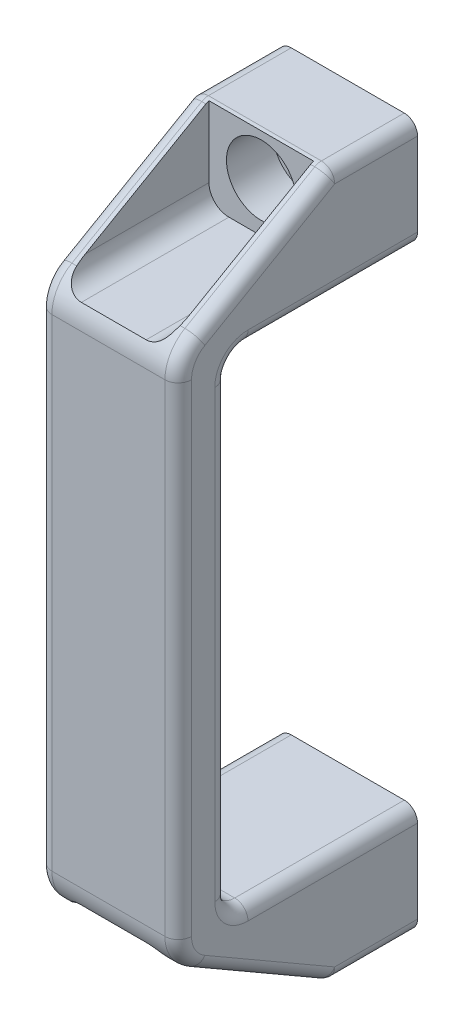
ISO-10303-21;
HEADER;
FILE_DESCRIPTION(('STEP AP214'),'2;1');
FILE_NAME('part.step','',(''),(''),'','','');
FILE_SCHEMA(('AUTOMOTIVE_DESIGN { 1 0 10303 214 1 1 1 1 }'));
ENDSEC;
DATA;
#1=APPLICATION_CONTEXT('core data for automotive mechanical design processes');
#2=APPLICATION_PROTOCOL_DEFINITION('international standard','automotive_design',2000,#1);
#3=PRODUCT_CONTEXT('',#1,'mechanical');
#4=PRODUCT('Part','Part','',(#3));
#5=PRODUCT_RELATED_PRODUCT_CATEGORY('part','',(#4));
#6=PRODUCT_DEFINITION_FORMATION('','',#4);
#7=PRODUCT_DEFINITION_CONTEXT('part definition',#1,'design');
#8=PRODUCT_DEFINITION('design','',#6,#7);
#9=PRODUCT_DEFINITION_SHAPE('','',#8);
#10=(LENGTH_UNIT() NAMED_UNIT(*) SI_UNIT(.MILLI.,.METRE.));
#11=(NAMED_UNIT(*) PLANE_ANGLE_UNIT() SI_UNIT($,.RADIAN.));
#12=(NAMED_UNIT(*) SI_UNIT($,.STERADIAN.) SOLID_ANGLE_UNIT());
#13=UNCERTAINTY_MEASURE_WITH_UNIT(LENGTH_MEASURE(1.E-05),#10,'distance_accuracy_value','');
#14=(GEOMETRIC_REPRESENTATION_CONTEXT(3) GLOBAL_UNCERTAINTY_ASSIGNED_CONTEXT((#13)) GLOBAL_UNIT_ASSIGNED_CONTEXT((#10,
#11,#12)) REPRESENTATION_CONTEXT('',''));
#15=CARTESIAN_POINT('',(0.,0.,0.));
#16=DIRECTION('',(0.,0.,1.));
#17=DIRECTION('',(1.,0.,0.));
#18=AXIS2_PLACEMENT_3D('',#15,#16,#17);
#19=CARTESIAN_POINT('',(0.,4.25,6.));
#20=DIRECTION('',(0.,0.,-1.));
#21=DIRECTION('',(-1.,0.,0.));
#22=AXIS2_PLACEMENT_3D('',#19,#20,#21);
#23=PLANE('',#22);
#24=CARTESIAN_POINT('',(0.,0.,6.));
#25=DIRECTION('',(0.,0.,1.));
#26=DIRECTION('',(1.,0.,0.));
#27=AXIS2_PLACEMENT_3D('',#24,#25,#26);
#28=CIRCLE('',#27,3.25);
#29=CARTESIAN_POINT('',(3.25,0.,6.));
#30=VERTEX_POINT('',#29);
#31=EDGE_CURVE('E941',#30,#30,#28,.F.);
#32=ORIENTED_EDGE('',*,*,#31,.T.);
#33=EDGE_LOOP('',(#32));
#34=FACE_BOUND('',#33,.T.);
#35=CARTESIAN_POINT('',(0.,0.,6.));
#36=DIRECTION('',(0.,0.,1.));
#37=DIRECTION('',(1.,0.,0.));
#38=AXIS2_PLACEMENT_3D('',#35,#36,#37);
#39=CIRCLE('',#38,5.25);
#40=CARTESIAN_POINT('',(5.25,0.,6.));
#41=VERTEX_POINT('',#40);
#42=EDGE_CURVE('E19',#41,#41,#39,.T.);
#43=ORIENTED_EDGE('',*,*,#42,.T.);
#44=EDGE_LOOP('',(#43));
#45=FACE_BOUND('',#44,.T.);
#46=ADVANCED_FACE('F15',(#34,#45),#23,.F.);
#47=CARTESIAN_POINT('',(5.355,98.355,6.));
#48=DIRECTION('',(0.,0.,-1.));
#49=DIRECTION('',(0.,-1.,0.));
#50=AXIS2_PLACEMENT_3D('',#47,#48,#49);
#51=PLANE('',#50);
#52=CARTESIAN_POINT('',(0.,93.,6.));
#53=DIRECTION('',(0.,0.,1.));
#54=DIRECTION('',(1.,0.,0.));
#55=AXIS2_PLACEMENT_3D('',#52,#53,#54);
#56=CIRCLE('',#55,3.25);
#57=CARTESIAN_POINT('',(3.25000000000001,93.,6.));
#58=VERTEX_POINT('',#57);
#59=EDGE_CURVE('E944',#58,#58,#56,.F.);
#60=ORIENTED_EDGE('',*,*,#59,.T.);
#61=EDGE_LOOP('',(#60));
#62=FACE_BOUND('',#61,.T.);
#63=CARTESIAN_POINT('',(0.,93.,6.));
#64=DIRECTION('',(0.,0.,1.));
#65=DIRECTION('',(1.,0.,0.));
#66=AXIS2_PLACEMENT_3D('',#63,#64,#65);
#67=CIRCLE('',#66,5.25);
#68=CARTESIAN_POINT('',(5.25,93.,6.));
#69=VERTEX_POINT('',#68);
#70=EDGE_CURVE('E937',#69,#69,#67,.T.);
#71=ORIENTED_EDGE('',*,*,#70,.T.);
#72=EDGE_LOOP('',(#71));
#73=FACE_BOUND('',#72,.T.);
#74=ADVANCED_FACE('F351',(#62,#73),#51,.F.);
#75=CARTESIAN_POINT('',(0.,0.,9.5));
#76=DIRECTION('',(0.,0.,1.));
#77=DIRECTION('',(1.,0.,0.));
#78=AXIS2_PLACEMENT_3D('',#75,#76,#77);
#79=CYLINDRICAL_SURFACE('',#78,5.25);
#80=ORIENTED_EDGE('',*,*,#42,.F.);
#81=EDGE_LOOP('',(#80));
#82=FACE_BOUND('',#81,.T.);
#83=CARTESIAN_POINT('',(0.,0.,13.));
#84=DIRECTION('',(0.,0.,1.));
#85=DIRECTION('',(1.,0.,0.));
#86=AXIS2_PLACEMENT_3D('',#83,#84,#85);
#87=CIRCLE('',#86,5.25);
#88=CARTESIAN_POINT('',(5.25,0.,13.));
#89=VERTEX_POINT('',#88);
#90=EDGE_CURVE('E304',#89,#89,#87,.T.);
#91=ORIENTED_EDGE('',*,*,#90,.T.);
#92=EDGE_LOOP('',(#91));
#93=FACE_BOUND('',#92,.T.);
#94=ADVANCED_FACE('F345',(#82,#93),#79,.F.);
#95=CARTESIAN_POINT('',(-8.5,-4.49999999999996,12.4641016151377));
#96=DIRECTION('',(1.,0.,0.));
#97=DIRECTION('',(0.,1.,0.));
#98=AXIS2_PLACEMENT_3D('',#95,#96,#97);
#99=SPHERICAL_SURFACE('',#98,2.);
#100=CARTESIAN_POINT('',(-8.5,-4.49999999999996,12.4641016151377));
#101=DIRECTION('',(0.,-0.5,-0.866025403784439));
#102=DIRECTION('',(0.,0.866025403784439,-0.5));
#103=AXIS2_PLACEMENT_3D('',#100,#101,#102);
#104=CIRCLE('',#103,2.);
#105=CARTESIAN_POINT('',(-10.5,-4.49999999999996,12.4641016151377));
#106=VERTEX_POINT('',#105);
#107=CARTESIAN_POINT('',(-8.50000000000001,-6.23205080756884,13.4641016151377));
#108=VERTEX_POINT('',#107);
#109=EDGE_CURVE('E305',#106,#108,#104,.F.);
#110=ORIENTED_EDGE('',*,*,#109,.F.);
#111=CARTESIAN_POINT('',(-8.5,-4.49999999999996,12.4641016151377));
#112=DIRECTION('',(0.,0.,-1.));
#113=DIRECTION('',(-1.,0.,0.));
#114=AXIS2_PLACEMENT_3D('',#111,#112,#113);
#115=CIRCLE('',#114,2.);
#116=CARTESIAN_POINT('',(-8.5,-6.49999999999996,12.4641016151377));
#117=VERTEX_POINT('',#116);
#118=EDGE_CURVE('E1043',#117,#106,#115,.T.);
#119=ORIENTED_EDGE('',*,*,#118,.F.);
#120=CARTESIAN_POINT('',(-8.5,-4.49999999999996,12.4641016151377));
#121=DIRECTION('',(-1.,0.,0.));
#122=DIRECTION('',(0.,0.,1.));
#123=AXIS2_PLACEMENT_3D('',#120,#121,#122);
#124=CIRCLE('',#123,2.);
#125=EDGE_CURVE('E316',#108,#117,#124,.F.);
#126=ORIENTED_EDGE('',*,*,#125,.F.);
#127=EDGE_LOOP('',(#110,#119,#126));
#128=FACE_BOUND('',#127,.T.);
#129=ADVANCED_FACE('F340',(#128),#99,.T.);
#130=CARTESIAN_POINT('',(0.,93.,0.));
#131=DIRECTION('',(0.,0.,1.));
#132=DIRECTION('',(1.,0.,0.));
#133=AXIS2_PLACEMENT_3D('',#130,#131,#132);
#134=CYLINDRICAL_SURFACE('',#133,3.25);
#135=CARTESIAN_POINT('',(0.,93.,0.));
#136=DIRECTION('',(0.,0.,1.));
#137=DIRECTION('',(1.,0.,0.));
#138=AXIS2_PLACEMENT_3D('',#135,#136,#137);
#139=CIRCLE('',#138,3.25);
#140=CARTESIAN_POINT('',(3.25000000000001,93.,0.));
#141=VERTEX_POINT('',#140);
#142=EDGE_CURVE('E926',#141,#141,#139,.T.);
#143=ORIENTED_EDGE('',*,*,#142,.F.);
#144=EDGE_LOOP('',(#143));
#145=FACE_BOUND('',#144,.T.);
#146=ORIENTED_EDGE('',*,*,#59,.F.);
#147=EDGE_LOOP('',(#146));
#148=FACE_BOUND('',#147,.T.);
#149=ADVANCED_FACE('F344',(#145,#148),#134,.F.);
#150=CARTESIAN_POINT('',(-8.5,83.,0.));
#151=DIRECTION('',(0.,-1.,0.));
#152=DIRECTION('',(1.,0.,0.));
#153=AXIS2_PLACEMENT_3D('',#150,#151,#152);
#154=PLANE('',#153);
#155=DIRECTION('',(0.,0.,1.));
#156=VECTOR('',#155,1.);
#157=CARTESIAN_POINT('',(-8.5,83.,11.20259561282));
#158=LINE('',#157,#156);
#159=CARTESIAN_POINT('',(-8.5,83.,0.));
#160=VERTEX_POINT('',#159);
#161=CARTESIAN_POINT('',(-8.5,83.,25.5));
#162=VERTEX_POINT('',#161);
#163=EDGE_CURVE('E1033',#160,#162,#158,.T.);
#164=ORIENTED_EDGE('',*,*,#163,.F.);
#165=DIRECTION('',(-1.,0.,0.));
#166=VECTOR('',#165,1.);
#167=CARTESIAN_POINT('',(0.,83.,0.));
#168=LINE('',#167,#166);
#169=CARTESIAN_POINT('',(8.5,83.,0.));
#170=VERTEX_POINT('',#169);
#171=EDGE_CURVE('E674',#170,#160,#168,.T.);
#172=ORIENTED_EDGE('',*,*,#171,.F.);
#173=DIRECTION('',(0.,0.,1.));
#174=VECTOR('',#173,1.);
#175=CARTESIAN_POINT('',(8.5,83.,11.20259561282));
#176=LINE('',#175,#174);
#177=CARTESIAN_POINT('',(8.5,83.,25.5));
#178=VERTEX_POINT('',#177);
#179=EDGE_CURVE('E667',#178,#170,#176,.F.);
#180=ORIENTED_EDGE('',*,*,#179,.F.);
#181=DIRECTION('',(1.,0.,0.));
#182=VECTOR('',#181,1.);
#183=CARTESIAN_POINT('',(0.,83.,25.5));
#184=LINE('',#183,#182);
#185=EDGE_CURVE('E946',#162,#178,#184,.T.);
#186=ORIENTED_EDGE('',*,*,#185,.F.);
#187=EDGE_LOOP('',(#164,#172,#180,#186));
#188=FACE_BOUND('',#187,.T.);
#189=ADVANCED_FACE('F361',(#188),#154,.T.);
#190=CARTESIAN_POINT('',(-8.5,80.,25.5));
#191=DIRECTION('',(1.,0.,0.));
#192=DIRECTION('',(0.,0.,-1.));
#193=AXIS2_PLACEMENT_3D('',#190,#191,#192);
#194=CYLINDRICAL_SURFACE('',#193,2.99999999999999);
#195=CARTESIAN_POINT('',(-8.5,80.,25.5));
#196=DIRECTION('',(1.,0.,0.));
#197=DIRECTION('',(0.,0.,-1.));
#198=AXIS2_PLACEMENT_3D('',#195,#196,#197);
#199=CIRCLE('',#198,2.99999999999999);
#200=CARTESIAN_POINT('',(-8.5,80.,28.5));
#201=VERTEX_POINT('',#200);
#202=EDGE_CURVE('E1008',#162,#201,#199,.T.);
#203=ORIENTED_EDGE('',*,*,#202,.F.);
#204=ORIENTED_EDGE('',*,*,#185,.T.);
#205=CARTESIAN_POINT('',(8.5,80.,25.5));
#206=DIRECTION('',(1.,0.,0.));
#207=DIRECTION('',(0.,0.,-1.));
#208=AXIS2_PLACEMENT_3D('',#205,#206,#207);
#209=CIRCLE('',#208,2.99999999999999);
#210=CARTESIAN_POINT('',(8.5,80.,28.5));
#211=VERTEX_POINT('',#210);
#212=EDGE_CURVE('E644',#211,#178,#209,.F.);
#213=ORIENTED_EDGE('',*,*,#212,.F.);
#214=DIRECTION('',(1.,0.,0.));
#215=VECTOR('',#214,1.);
#216=CARTESIAN_POINT('',(0.,80.,28.5));
#217=LINE('',#216,#215);
#218=EDGE_CURVE('E949',#201,#211,#217,.T.);
#219=ORIENTED_EDGE('',*,*,#218,.F.);
#220=EDGE_LOOP('',(#203,#204,#213,#219));
#221=FACE_BOUND('',#220,.T.);
#222=ADVANCED_FACE('F365',(#221),#194,.F.);
#223=CARTESIAN_POINT('',(8.5,13.,28.5));
#224=DIRECTION('',(0.,0.,-1.));
#225=DIRECTION('',(-1.,0.,0.));
#226=AXIS2_PLACEMENT_3D('',#223,#224,#225);
#227=PLANE('',#226);
#228=DIRECTION('',(0.,1.,0.));
#229=VECTOR('',#228,1.);
#230=CARTESIAN_POINT('',(-8.5,63.,28.5));
#231=LINE('',#230,#229);
#232=CARTESIAN_POINT('',(-8.5,13.,28.5));
#233=VERTEX_POINT('',#232);
#234=EDGE_CURVE('E1002',#201,#233,#231,.F.);
#235=ORIENTED_EDGE('',*,*,#234,.F.);
#236=ORIENTED_EDGE('',*,*,#218,.T.);
#237=DIRECTION('',(0.,-1.,0.));
#238=VECTOR('',#237,1.);
#239=CARTESIAN_POINT('',(8.5,63.,28.5));
#240=LINE('',#239,#238);
#241=CARTESIAN_POINT('',(8.5,13.,28.5));
#242=VERTEX_POINT('',#241);
#243=EDGE_CURVE('E643',#242,#211,#240,.F.);
#244=ORIENTED_EDGE('',*,*,#243,.F.);
#245=DIRECTION('',(-1.,0.,0.));
#246=VECTOR('',#245,1.);
#247=CARTESIAN_POINT('',(10.5,13.,28.5));
#248=LINE('',#247,#246);
#249=EDGE_CURVE('E1084',#242,#233,#248,.T.);
#250=ORIENTED_EDGE('',*,*,#249,.T.);
#251=EDGE_LOOP('',(#235,#236,#244,#250));
#252=FACE_BOUND('',#251,.T.);
#253=ADVANCED_FACE('F369',(#252),#227,.T.);
#254=CARTESIAN_POINT('',(10.5,13.,25.5));
#255=DIRECTION('',(-1.,0.,0.));
#256=DIRECTION('',(0.,0.,1.));
#257=AXIS2_PLACEMENT_3D('',#254,#255,#256);
#258=CYLINDRICAL_SURFACE('',#257,2.99999999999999);
#259=DIRECTION('',(1.,0.,0.));
#260=VECTOR('',#259,1.);
#261=CARTESIAN_POINT('',(10.5,10.,25.5));
#262=LINE('',#261,#260);
#263=CARTESIAN_POINT('',(-8.5,10.,25.5));
#264=VERTEX_POINT('',#263);
#265=CARTESIAN_POINT('',(8.5,10.,25.5));
#266=VERTEX_POINT('',#265);
#267=EDGE_CURVE('E943',#264,#266,#262,.T.);
#268=ORIENTED_EDGE('',*,*,#267,.F.);
#269=CARTESIAN_POINT('',(-8.5,13.,25.5));
#270=DIRECTION('',(-1.,0.,0.));
#271=DIRECTION('',(0.,0.,1.));
#272=AXIS2_PLACEMENT_3D('',#269,#270,#271);
#273=CIRCLE('',#272,2.99999999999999);
#274=EDGE_CURVE('E337',#233,#264,#273,.F.);
#275=ORIENTED_EDGE('',*,*,#274,.F.);
#276=ORIENTED_EDGE('',*,*,#249,.F.);
#277=CARTESIAN_POINT('',(8.5,13.,25.5));
#278=DIRECTION('',(-1.,0.,0.));
#279=DIRECTION('',(0.,0.,1.));
#280=AXIS2_PLACEMENT_3D('',#277,#278,#279);
#281=CIRCLE('',#280,2.99999999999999);
#282=EDGE_CURVE('E637',#266,#242,#281,.T.);
#283=ORIENTED_EDGE('',*,*,#282,.F.);
#284=EDGE_LOOP('',(#268,#275,#276,#283));
#285=FACE_BOUND('',#284,.T.);
#286=ADVANCED_FACE('F347',(#285),#258,.F.);
#287=CARTESIAN_POINT('',(10.5,10.,0.));
#288=DIRECTION('',(0.,1.,0.));
#289=DIRECTION('',(0.,0.,1.));
#290=AXIS2_PLACEMENT_3D('',#287,#288,#289);
#291=PLANE('',#290);
#292=DIRECTION('',(0.,0.,1.));
#293=VECTOR('',#292,1.);
#294=CARTESIAN_POINT('',(-8.5,10.,11.20259561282));
#295=LINE('',#294,#293);
#296=CARTESIAN_POINT('',(-8.5,10.,0.));
#297=VERTEX_POINT('',#296);
#298=EDGE_CURVE('E720',#264,#297,#295,.F.);
#299=ORIENTED_EDGE('',*,*,#298,.F.);
#300=ORIENTED_EDGE('',*,*,#267,.T.);
#301=DIRECTION('',(0.,0.,1.));
#302=VECTOR('',#301,1.);
#303=CARTESIAN_POINT('',(8.5,10.,11.20259561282));
#304=LINE('',#303,#302);
#305=CARTESIAN_POINT('',(8.5,10.,0.));
#306=VERTEX_POINT('',#305);
#307=EDGE_CURVE('E609',#306,#266,#304,.T.);
#308=ORIENTED_EDGE('',*,*,#307,.F.);
#309=DIRECTION('',(-1.,0.,0.));
#310=VECTOR('',#309,1.);
#311=CARTESIAN_POINT('',(10.5,10.,0.));
#312=LINE('',#311,#310);
#313=EDGE_CURVE('E586',#297,#306,#312,.F.);
#314=ORIENTED_EDGE('',*,*,#313,.F.);
#315=EDGE_LOOP('',(#299,#300,#308,#314));
#316=FACE_BOUND('',#315,.T.);
#317=ADVANCED_FACE('F1359',(#316),#291,.T.);
#318=CARTESIAN_POINT('',(0.,0.,3.));
#319=DIRECTION('',(0.,0.,1.));
#320=DIRECTION('',(1.,0.,0.));
#321=AXIS2_PLACEMENT_3D('',#318,#319,#320);
#322=CYLINDRICAL_SURFACE('',#321,3.25);
#323=CARTESIAN_POINT('',(0.,0.,0.));
#324=DIRECTION('',(0.,0.,1.));
#325=DIRECTION('',(1.,0.,0.));
#326=AXIS2_PLACEMENT_3D('',#323,#324,#325);
#327=CIRCLE('',#326,3.25);
#328=CARTESIAN_POINT('',(3.25,0.,0.));
#329=VERTEX_POINT('',#328);
#330=EDGE_CURVE('E914',#329,#329,#327,.T.);
#331=ORIENTED_EDGE('',*,*,#330,.F.);
#332=EDGE_LOOP('',(#331));
#333=FACE_BOUND('',#332,.T.);
#334=ORIENTED_EDGE('',*,*,#31,.F.);
#335=EDGE_LOOP('',(#334));
#336=FACE_BOUND('',#335,.T.);
#337=ADVANCED_FACE('F1068',(#333,#336),#322,.F.);
#338=CARTESIAN_POINT('',(8.5,-4.49999999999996,12.4641016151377));
#339=DIRECTION('',(1.,0.,0.));
#340=DIRECTION('',(0.,1.,0.));
#341=AXIS2_PLACEMENT_3D('',#338,#339,#340);
#342=SPHERICAL_SURFACE('',#341,2.);
#343=CARTESIAN_POINT('',(8.5,-4.49999999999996,12.4641016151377));
#344=DIRECTION('',(0.,0.,-1.));
#345=DIRECTION('',(-1.,0.,0.));
#346=AXIS2_PLACEMENT_3D('',#343,#344,#345);
#347=CIRCLE('',#346,2.);
#348=CARTESIAN_POINT('',(10.5,-4.49999999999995,12.4641016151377));
#349=VERTEX_POINT('',#348);
#350=CARTESIAN_POINT('',(8.5,-6.49999999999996,12.4641016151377));
#351=VERTEX_POINT('',#350);
#352=EDGE_CURVE('E703',#349,#351,#347,.T.);
#353=ORIENTED_EDGE('',*,*,#352,.F.);
#354=CARTESIAN_POINT('',(8.5,-4.49999999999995,12.4641016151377));
#355=DIRECTION('',(0.,-0.5,-0.866025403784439));
#356=DIRECTION('',(0.,0.866025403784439,-0.5));
#357=AXIS2_PLACEMENT_3D('',#354,#355,#356);
#358=CIRCLE('',#357,2.);
#359=CARTESIAN_POINT('',(8.5,-6.23205080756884,13.4641016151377));
#360=VERTEX_POINT('',#359);
#361=EDGE_CURVE('E695',#360,#349,#358,.F.);
#362=ORIENTED_EDGE('',*,*,#361,.F.);
#363=CARTESIAN_POINT('',(8.5,-4.49999999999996,12.4641016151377));
#364=DIRECTION('',(-1.,0.,0.));
#365=DIRECTION('',(0.,0.,1.));
#366=AXIS2_PLACEMENT_3D('',#363,#364,#365);
#367=CIRCLE('',#366,2.);
#368=EDGE_CURVE('E323',#351,#360,#367,.T.);
#369=ORIENTED_EDGE('',*,*,#368,.F.);
#370=EDGE_LOOP('',(#353,#362,#369));
#371=FACE_BOUND('',#370,.T.);
#372=ADVANCED_FACE('F1063',(#371),#342,.T.);
#373=CARTESIAN_POINT('',(10.5,-6.49999999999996,13.));
#374=DIRECTION('',(0.,-1.,0.));
#375=DIRECTION('',(0.,0.,-1.));
#376=AXIS2_PLACEMENT_3D('',#373,#374,#375);
#377=PLANE('',#376);
#378=DIRECTION('',(0.,0.,-1.));
#379=VECTOR('',#378,1.);
#380=CARTESIAN_POINT('',(-8.5,-6.49999999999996,17.70259561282));
#381=LINE('',#380,#379);
#382=CARTESIAN_POINT('',(-8.5,-6.49999999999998,0.));
#383=VERTEX_POINT('',#382);
#384=EDGE_CURVE('E940',#383,#117,#381,.F.);
#385=ORIENTED_EDGE('',*,*,#384,.F.);
#386=DIRECTION('',(-1.,0.,0.));
#387=VECTOR('',#386,1.);
#388=CARTESIAN_POINT('',(10.5,-6.5,0.));
#389=LINE('',#388,#387);
#390=CARTESIAN_POINT('',(8.5,-6.49999999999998,0.));
#391=VERTEX_POINT('',#390);
#392=EDGE_CURVE('E596',#391,#383,#389,.T.);
#393=ORIENTED_EDGE('',*,*,#392,.F.);
#394=DIRECTION('',(0.,0.,-1.));
#395=VECTOR('',#394,1.);
#396=CARTESIAN_POINT('',(8.5,-6.49999999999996,17.70259561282));
#397=LINE('',#396,#395);
#398=EDGE_CURVE('E706',#351,#391,#397,.T.);
#399=ORIENTED_EDGE('',*,*,#398,.F.);
#400=DIRECTION('',(-1.,0.,0.));
#401=VECTOR('',#400,1.);
#402=CARTESIAN_POINT('',(10.5,-6.49999999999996,12.4641016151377));
#403=LINE('',#402,#401);
#404=EDGE_CURVE('E331',#117,#351,#403,.F.);
#405=ORIENTED_EDGE('',*,*,#404,.F.);
#406=EDGE_LOOP('',(#385,#393,#399,#405));
#407=FACE_BOUND('',#406,.T.);
#408=ADVANCED_FACE('F378',(#407),#377,.T.);
#409=CARTESIAN_POINT('',(0.,93.,6.));
#410=DIRECTION('',(0.,0.,1.));
#411=DIRECTION('',(1.,0.,0.));
#412=AXIS2_PLACEMENT_3D('',#409,#410,#411);
#413=CYLINDRICAL_SURFACE('',#412,5.25);
#414=ORIENTED_EDGE('',*,*,#70,.F.);
#415=EDGE_LOOP('',(#414));
#416=FACE_BOUND('',#415,.T.);
#417=CARTESIAN_POINT('',(0.,93.,13.));
#418=DIRECTION('',(0.,0.,1.));
#419=DIRECTION('',(1.,0.,0.));
#420=AXIS2_PLACEMENT_3D('',#417,#418,#419);
#421=CIRCLE('',#420,5.25);
#422=CARTESIAN_POINT('',(5.25,93.,13.));
#423=VERTEX_POINT('',#422);
#424=EDGE_CURVE('E801',#423,#423,#421,.T.);
#425=ORIENTED_EDGE('',*,*,#424,.T.);
#426=EDGE_LOOP('',(#425));
#427=FACE_BOUND('',#426,.T.);
#428=ADVANCED_FACE('F374',(#416,#427),#413,.F.);
#429=CARTESIAN_POINT('',(8.5,97.5,12.4641016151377));
#430=DIRECTION('',(1.,0.,0.));
#431=DIRECTION('',(0.,1.,0.));
#432=AXIS2_PLACEMENT_3D('',#429,#430,#431);
#433=SPHERICAL_SURFACE('',#432,2.);
#434=CARTESIAN_POINT('',(8.5,97.5,12.4641016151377));
#435=DIRECTION('',(0.,0.5,-0.866025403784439));
#436=DIRECTION('',(0.,0.866025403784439,0.5));
#437=AXIS2_PLACEMENT_3D('',#434,#435,#436);
#438=CIRCLE('',#437,2.);
#439=CARTESIAN_POINT('',(10.5,97.5,12.4641016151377));
#440=VERTEX_POINT('',#439);
#441=CARTESIAN_POINT('',(8.5,99.2320508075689,13.4641016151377));
#442=VERTEX_POINT('',#441);
#443=EDGE_CURVE('E808',#440,#442,#438,.F.);
#444=ORIENTED_EDGE('',*,*,#443,.F.);
#445=CARTESIAN_POINT('',(8.5,97.5,12.4641016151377));
#446=DIRECTION('',(0.,0.,-1.));
#447=DIRECTION('',(-1.,0.,0.));
#448=AXIS2_PLACEMENT_3D('',#445,#446,#447);
#449=CIRCLE('',#448,2.);
#450=CARTESIAN_POINT('',(8.5,99.5,12.4641016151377));
#451=VERTEX_POINT('',#450);
#452=EDGE_CURVE('E685',#451,#440,#449,.T.);
#453=ORIENTED_EDGE('',*,*,#452,.F.);
#454=CARTESIAN_POINT('',(8.5,97.5,12.4641016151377));
#455=DIRECTION('',(-1.,0.,0.));
#456=DIRECTION('',(0.,0.,1.));
#457=AXIS2_PLACEMENT_3D('',#454,#455,#456);
#458=CIRCLE('',#457,2.);
#459=EDGE_CURVE('E815',#442,#451,#458,.T.);
#460=ORIENTED_EDGE('',*,*,#459,.F.);
#461=EDGE_LOOP('',(#444,#453,#460));
#462=FACE_BOUND('',#461,.T.);
#463=ADVANCED_FACE('F377',(#462),#433,.T.);
#464=CARTESIAN_POINT('',(8.5,99.5,0.));
#465=DIRECTION('',(0.,1.,0.));
#466=DIRECTION('',(-1.,0.,0.));
#467=AXIS2_PLACEMENT_3D('',#464,#465,#466);
#468=PLANE('',#467);
#469=DIRECTION('',(0.,0.,-1.));
#470=VECTOR('',#469,1.);
#471=CARTESIAN_POINT('',(8.5,99.5,17.70259561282));
#472=LINE('',#471,#470);
#473=CARTESIAN_POINT('',(8.5,99.5,0.));
#474=VERTEX_POINT('',#473);
#475=EDGE_CURVE('E688',#474,#451,#472,.F.);
#476=ORIENTED_EDGE('',*,*,#475,.F.);
#477=DIRECTION('',(1.,0.,0.));
#478=VECTOR('',#477,1.);
#479=CARTESIAN_POINT('',(0.,99.5,0.));
#480=LINE('',#479,#478);
#481=CARTESIAN_POINT('',(-8.5,99.5,0.));
#482=VERTEX_POINT('',#481);
#483=EDGE_CURVE('E679',#482,#474,#480,.T.);
#484=ORIENTED_EDGE('',*,*,#483,.F.);
#485=DIRECTION('',(0.,0.,-1.));
#486=VECTOR('',#485,1.);
#487=CARTESIAN_POINT('',(-8.5,99.5,17.70259561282));
#488=LINE('',#487,#486);
#489=CARTESIAN_POINT('',(-8.5,99.5,12.4641016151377));
#490=VERTEX_POINT('',#489);
#491=EDGE_CURVE('E329',#490,#482,#488,.T.);
#492=ORIENTED_EDGE('',*,*,#491,.F.);
#493=DIRECTION('',(-1.,0.,0.));
#494=VECTOR('',#493,1.);
#495=CARTESIAN_POINT('',(10.5,99.5,12.4641016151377));
#496=LINE('',#495,#494);
#497=EDGE_CURVE('E796',#451,#490,#496,.T.);
#498=ORIENTED_EDGE('',*,*,#497,.F.);
#499=EDGE_LOOP('',(#476,#484,#492,#498));
#500=FACE_BOUND('',#499,.T.);
#501=ADVANCED_FACE('F380',(#500),#468,.T.);
#502=CARTESIAN_POINT('',(-8.5,97.5,12.4641016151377));
#503=DIRECTION('',(1.,0.,0.));
#504=DIRECTION('',(0.,1.,0.));
#505=AXIS2_PLACEMENT_3D('',#502,#503,#504);
#506=SPHERICAL_SURFACE('',#505,2.);
#507=CARTESIAN_POINT('',(-8.5,97.5,12.4641016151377));
#508=DIRECTION('',(0.,0.,-1.));
#509=DIRECTION('',(-1.,0.,0.));
#510=AXIS2_PLACEMENT_3D('',#507,#508,#509);
#511=CIRCLE('',#510,2.);
#512=CARTESIAN_POINT('',(-10.5,97.5,12.4641016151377));
#513=VERTEX_POINT('',#512);
#514=EDGE_CURVE('E1040',#513,#490,#511,.T.);
#515=ORIENTED_EDGE('',*,*,#514,.F.);
#516=CARTESIAN_POINT('',(-8.5,97.5,12.4641016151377));
#517=DIRECTION('',(0.,0.5,-0.866025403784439));
#518=DIRECTION('',(0.,0.866025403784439,0.5));
#519=AXIS2_PLACEMENT_3D('',#516,#517,#518);
#520=CIRCLE('',#519,2.);
#521=CARTESIAN_POINT('',(-8.5,99.2320508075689,13.4641016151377));
#522=VERTEX_POINT('',#521);
#523=EDGE_CURVE('E788',#522,#513,#520,.F.);
#524=ORIENTED_EDGE('',*,*,#523,.F.);
#525=CARTESIAN_POINT('',(-8.5,97.5,12.4641016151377));
#526=DIRECTION('',(-1.,0.,0.));
#527=DIRECTION('',(0.,0.,1.));
#528=AXIS2_PLACEMENT_3D('',#525,#526,#527);
#529=CIRCLE('',#528,2.);
#530=EDGE_CURVE('E797',#490,#522,#529,.F.);
#531=ORIENTED_EDGE('',*,*,#530,.F.);
#532=EDGE_LOOP('',(#515,#524,#531));
#533=FACE_BOUND('',#532,.T.);
#534=ADVANCED_FACE('F383',(#533),#506,.T.);
#535=CARTESIAN_POINT('',(-8.5,-4.49999999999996,17.70259561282));
#536=DIRECTION('',(0.,0.,-1.));
#537=DIRECTION('',(-1.,0.,0.));
#538=AXIS2_PLACEMENT_3D('',#535,#536,#537);
#539=CYLINDRICAL_SURFACE('',#538,2.);
#540=ORIENTED_EDGE('',*,*,#118,.T.);
#541=DIRECTION('',(0.,0.,1.));
#542=VECTOR('',#541,1.);
#543=CARTESIAN_POINT('',(-10.5,-4.49999999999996,17.));
#544=LINE('',#543,#542);
#545=CARTESIAN_POINT('',(-10.5,-4.49999999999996,0.));
#546=VERTEX_POINT('',#545);
#547=EDGE_CURVE('E904',#546,#106,#544,.T.);
#548=ORIENTED_EDGE('',*,*,#547,.F.);
#549=CARTESIAN_POINT('',(-8.5,-4.49999999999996,0.));
#550=DIRECTION('',(0.,0.,-1.));
#551=DIRECTION('',(-1.,0.,0.));
#552=AXIS2_PLACEMENT_3D('',#549,#550,#551);
#553=CIRCLE('',#552,2.);
#554=EDGE_CURVE('E599',#383,#546,#553,.T.);
#555=ORIENTED_EDGE('',*,*,#554,.F.);
#556=ORIENTED_EDGE('',*,*,#384,.T.);
#557=EDGE_LOOP('',(#540,#548,#555,#556));
#558=FACE_BOUND('',#557,.T.);
#559=ADVANCED_FACE('F1056',(#558),#539,.T.);
#560=CARTESIAN_POINT('',(-8.5,97.5,17.70259561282));
#561=DIRECTION('',(0.,0.,-1.));
#562=DIRECTION('',(-1.,0.,0.));
#563=AXIS2_PLACEMENT_3D('',#560,#561,#562);
#564=CYLINDRICAL_SURFACE('',#563,2.);
#565=ORIENTED_EDGE('',*,*,#514,.T.);
#566=ORIENTED_EDGE('',*,*,#491,.T.);
#567=CARTESIAN_POINT('',(-8.5,97.5,0.));
#568=DIRECTION('',(0.,0.,-1.));
#569=DIRECTION('',(-1.,0.,0.));
#570=AXIS2_PLACEMENT_3D('',#567,#568,#569);
#571=CIRCLE('',#570,2.);
#572=CARTESIAN_POINT('',(-10.5,97.5,0.));
#573=VERTEX_POINT('',#572);
#574=EDGE_CURVE('E682',#573,#482,#571,.T.);
#575=ORIENTED_EDGE('',*,*,#574,.F.);
#576=DIRECTION('',(0.,0.,-1.));
#577=VECTOR('',#576,1.);
#578=CARTESIAN_POINT('',(-10.5,97.5,17.));
#579=LINE('',#578,#577);
#580=EDGE_CURVE('E898',#513,#573,#579,.T.);
#581=ORIENTED_EDGE('',*,*,#580,.F.);
#582=EDGE_LOOP('',(#565,#566,#575,#581));
#583=FACE_BOUND('',#582,.T.);
#584=ADVANCED_FACE('F1108',(#583),#564,.T.);
#585=CARTESIAN_POINT('',(-8.5,85.,11.20259561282));
#586=DIRECTION('',(0.,0.,1.));
#587=DIRECTION('',(1.,0.,0.));
#588=AXIS2_PLACEMENT_3D('',#585,#586,#587);
#589=CYLINDRICAL_SURFACE('',#588,2.);
#590=CARTESIAN_POINT('',(-8.5,85.,25.5));
#591=DIRECTION('',(0.,0.,1.));
#592=DIRECTION('',(0.,1.,0.));
#593=AXIS2_PLACEMENT_3D('',#590,#591,#592);
#594=CIRCLE('',#593,2.);
#595=CARTESIAN_POINT('',(-10.5,85.,25.5));
#596=VERTEX_POINT('',#595);
#597=EDGE_CURVE('E1025',#596,#162,#594,.T.);
#598=ORIENTED_EDGE('',*,*,#597,.F.);
#599=DIRECTION('',(0.,0.,1.));
#600=VECTOR('',#599,1.);
#601=CARTESIAN_POINT('',(-10.5,85.,17.));
#602=LINE('',#601,#600);
#603=CARTESIAN_POINT('',(-10.5,85.,0.));
#604=VERTEX_POINT('',#603);
#605=EDGE_CURVE('E774',#604,#596,#602,.T.);
#606=ORIENTED_EDGE('',*,*,#605,.F.);
#607=CARTESIAN_POINT('',(-8.5,85.,0.));
#608=DIRECTION('',(0.,0.,1.));
#609=DIRECTION('',(1.,0.,0.));
#610=AXIS2_PLACEMENT_3D('',#607,#608,#609);
#611=CIRCLE('',#610,2.);
#612=EDGE_CURVE('E677',#160,#604,#611,.F.);
#613=ORIENTED_EDGE('',*,*,#612,.F.);
#614=ORIENTED_EDGE('',*,*,#163,.T.);
#615=EDGE_LOOP('',(#598,#606,#613,#614));
#616=FACE_BOUND('',#615,.T.);
#617=ADVANCED_FACE('F1019',(#616),#589,.T.);
#618=CARTESIAN_POINT('',(-8.5,80.,25.5));
#619=DIRECTION('',(1.,0.,0.));
#620=DIRECTION('',(0.,0.,-1.));
#621=AXIS2_PLACEMENT_3D('',#618,#619,#620);
#622=TOROIDAL_SURFACE('',#621,4.99999999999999,2.);
#623=CARTESIAN_POINT('',(-8.5,80.,30.5));
#624=DIRECTION('',(0.,1.,0.));
#625=DIRECTION('',(0.,0.,1.));
#626=AXIS2_PLACEMENT_3D('',#623,#624,#625);
#627=CIRCLE('',#626,2.);
#628=CARTESIAN_POINT('',(-10.5,80.,30.5));
#629=VERTEX_POINT('',#628);
#630=EDGE_CURVE('E1005',#629,#201,#627,.F.);
#631=ORIENTED_EDGE('',*,*,#630,.F.);
#632=CARTESIAN_POINT('',(-10.5,80.,25.5));
#633=DIRECTION('',(-1.,0.,0.));
#634=DIRECTION('',(0.,0.,1.));
#635=AXIS2_PLACEMENT_3D('',#632,#633,#634);
#636=CIRCLE('',#635,4.99999999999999);
#637=EDGE_CURVE('E771',#596,#629,#636,.F.);
#638=ORIENTED_EDGE('',*,*,#637,.F.);
#639=ORIENTED_EDGE('',*,*,#597,.T.);
#640=ORIENTED_EDGE('',*,*,#202,.T.);
#641=EDGE_LOOP('',(#631,#638,#639,#640));
#642=FACE_BOUND('',#641,.T.);
#643=ADVANCED_FACE('F1015',(#642),#622,.T.);
#644=CARTESIAN_POINT('',(-8.5,63.,30.5));
#645=DIRECTION('',(0.,1.,0.));
#646=DIRECTION('',(0.,0.,1.));
#647=AXIS2_PLACEMENT_3D('',#644,#645,#646);
#648=CYLINDRICAL_SURFACE('',#647,2.);
#649=ORIENTED_EDGE('',*,*,#630,.T.);
#650=ORIENTED_EDGE('',*,*,#234,.T.);
#651=CARTESIAN_POINT('',(-8.5,13.,30.5));
#652=DIRECTION('',(0.,1.,0.));
#653=DIRECTION('',(0.,0.,1.));
#654=AXIS2_PLACEMENT_3D('',#651,#652,#653);
#655=CIRCLE('',#654,2.);
#656=CARTESIAN_POINT('',(-10.5,13.,30.5));
#657=VERTEX_POINT('',#656);
#658=EDGE_CURVE('E995',#657,#233,#655,.F.);
#659=ORIENTED_EDGE('',*,*,#658,.F.);
#660=DIRECTION('',(0.,-1.,0.));
#661=VECTOR('',#660,1.);
#662=CARTESIAN_POINT('',(-10.5,46.5,30.5));
#663=LINE('',#662,#661);
#664=EDGE_CURVE('E769',#629,#657,#663,.T.);
#665=ORIENTED_EDGE('',*,*,#664,.F.);
#666=EDGE_LOOP('',(#649,#650,#659,#665));
#667=FACE_BOUND('',#666,.T.);
#668=ADVANCED_FACE('F982',(#667),#648,.T.);
#669=CARTESIAN_POINT('',(-8.5,13.,25.5));
#670=DIRECTION('',(-1.,0.,0.));
#671=DIRECTION('',(0.,0.,1.));
#672=AXIS2_PLACEMENT_3D('',#669,#670,#671);
#673=TOROIDAL_SURFACE('',#672,4.99999999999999,2.);
#674=ORIENTED_EDGE('',*,*,#658,.T.);
#675=ORIENTED_EDGE('',*,*,#274,.T.);
#676=CARTESIAN_POINT('',(-8.5,8.,25.5));
#677=DIRECTION('',(0.,0.,1.));
#678=DIRECTION('',(1.,0.,0.));
#679=AXIS2_PLACEMENT_3D('',#676,#677,#678);
#680=CIRCLE('',#679,2.);
#681=CARTESIAN_POINT('',(-10.5,8.,25.5));
#682=VERTEX_POINT('',#681);
#683=EDGE_CURVE('E1077',#682,#264,#680,.F.);
#684=ORIENTED_EDGE('',*,*,#683,.F.);
#685=CARTESIAN_POINT('',(-10.5,13.,25.5));
#686=DIRECTION('',(-1.,0.,0.));
#687=DIRECTION('',(0.,-1.,0.));
#688=AXIS2_PLACEMENT_3D('',#685,#686,#687);
#689=CIRCLE('',#688,4.99999999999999);
#690=EDGE_CURVE('E442',#657,#682,#689,.F.);
#691=ORIENTED_EDGE('',*,*,#690,.F.);
#692=EDGE_LOOP('',(#674,#675,#684,#691));
#693=FACE_BOUND('',#692,.T.);
#694=ADVANCED_FACE('F976',(#693),#673,.T.);
#695=CARTESIAN_POINT('',(-8.5,8.,11.20259561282));
#696=DIRECTION('',(0.,0.,1.));
#697=DIRECTION('',(1.,0.,0.));
#698=AXIS2_PLACEMENT_3D('',#695,#696,#697);
#699=CYLINDRICAL_SURFACE('',#698,2.);
#700=ORIENTED_EDGE('',*,*,#683,.T.);
#701=ORIENTED_EDGE('',*,*,#298,.T.);
#702=CARTESIAN_POINT('',(-8.5,8.,0.));
#703=DIRECTION('',(0.,0.,1.));
#704=DIRECTION('',(1.,0.,0.));
#705=AXIS2_PLACEMENT_3D('',#702,#703,#704);
#706=CIRCLE('',#705,2.);
#707=CARTESIAN_POINT('',(-10.5,8.,0.));
#708=VERTEX_POINT('',#707);
#709=EDGE_CURVE('E595',#708,#297,#706,.F.);
#710=ORIENTED_EDGE('',*,*,#709,.F.);
#711=DIRECTION('',(0.,0.,-1.));
#712=VECTOR('',#711,1.);
#713=CARTESIAN_POINT('',(-10.5,8.,17.));
#714=LINE('',#713,#712);
#715=EDGE_CURVE('E765',#682,#708,#714,.T.);
#716=ORIENTED_EDGE('',*,*,#715,.F.);
#717=EDGE_LOOP('',(#700,#701,#710,#716));
#718=FACE_BOUND('',#717,.T.);
#719=ADVANCED_FACE('F972',(#718),#699,.T.);
#720=CARTESIAN_POINT('',(-8.5,9.60433713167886,36.8935301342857));
#721=DIRECTION('',(0.,-0.5,-0.866025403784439));
#722=DIRECTION('',(0.,0.866025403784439,-0.5));
#723=AXIS2_PLACEMENT_3D('',#720,#721,#722);
#724=CYLINDRICAL_SURFACE('',#723,2.);
#725=CARTESIAN_POINT('',(-8.5,6.77905619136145,32.));
#726=DIRECTION('',(0.,-0.5,-0.866025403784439));
#727=DIRECTION('',(0.,-0.866025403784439,0.5));
#728=AXIS2_PLACEMENT_3D('',#725,#726,#727);
#729=CIRCLE('',#728,2.);
#730=CARTESIAN_POINT('',(-10.5,6.77905619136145,32.));
#731=VERTEX_POINT('',#730);
#732=CARTESIAN_POINT('',(-8.5,5.04700538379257,33.));
#733=VERTEX_POINT('',#732);
#734=EDGE_CURVE('E754',#731,#733,#729,.F.);
#735=ORIENTED_EDGE('',*,*,#734,.F.);
#736=DIRECTION('',(0.,0.5,0.866025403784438));
#737=VECTOR('',#736,1.);
#738=CARTESIAN_POINT('',(-10.5,-4.49999999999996,12.4641016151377));
#739=LINE('',#738,#737);
#740=EDGE_CURVE('E899',#106,#731,#739,.T.);
#741=ORIENTED_EDGE('',*,*,#740,.F.);
#742=ORIENTED_EDGE('',*,*,#109,.T.);
#743=DIRECTION('',(0.,-0.5,-0.866025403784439));
#744=VECTOR('',#743,1.);
#745=CARTESIAN_POINT('',(-8.50000000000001,5.04700538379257,33.));
#746=LINE('',#745,#744);
#747=EDGE_CURVE('E887',#733,#108,#746,.T.);
#748=ORIENTED_EDGE('',*,*,#747,.F.);
#749=EDGE_LOOP('',(#735,#741,#742,#748));
#750=FACE_BOUND('',#749,.T.);
#751=ADVANCED_FACE('F966',(#750),#724,.T.);
#752=CARTESIAN_POINT('',(-7.875,4.25,49.));
#753=DIRECTION('',(-1.,0.,0.));
#754=DIRECTION('',(0.,0.,1.));
#755=AXIS2_PLACEMENT_3D('',#752,#753,#754);
#756=PLANE('',#755);
#757=DIRECTION('',(0.,1.,0.));
#758=VECTOR('',#757,1.);
#759=CARTESIAN_POINT('',(-7.87500000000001,0.03182076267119,13.));
#760=LINE('',#759,#758);
#761=CARTESIAN_POINT('',(-7.87500000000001,-6.42686608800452,13.));
#762=VERTEX_POINT('',#761);
#763=CARTESIAN_POINT('',(-7.875,4.25,13.));
#764=VERTEX_POINT('',#763);
#765=EDGE_CURVE('E294',#762,#764,#760,.T.);
#766=ORIENTED_EDGE('',*,*,#765,.T.);
#767=DIRECTION('',(0.,0.,-1.));
#768=VECTOR('',#767,1.);
#769=CARTESIAN_POINT('',(-7.875,4.25,49.));
#770=LINE('',#769,#768);
#771=CARTESIAN_POINT('',(-7.875,4.25,31.6195461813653));
#772=VERTEX_POINT('',#771);
#773=EDGE_CURVE('E885',#764,#772,#770,.F.);
#774=ORIENTED_EDGE('',*,*,#773,.T.);
#775=DIRECTION('',(0.,-0.5,-0.866025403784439));
#776=VECTOR('',#775,1.);
#777=CARTESIAN_POINT('',(-7.87500000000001,5.04700538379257,33.));
#778=LINE('',#777,#776);
#779=CARTESIAN_POINT('',(-7.87500000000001,-6.23205080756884,13.4641016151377));
#780=VERTEX_POINT('',#779);
#781=EDGE_CURVE('E312',#780,#772,#778,.F.);
#782=ORIENTED_EDGE('',*,*,#781,.F.);
#783=CARTESIAN_POINT('',(-7.87500000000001,-4.49999999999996,12.4641016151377));
#784=DIRECTION('',(-1.,0.,0.));
#785=DIRECTION('',(0.,0.,1.));
#786=AXIS2_PLACEMENT_3D('',#783,#784,#785);
#787=CIRCLE('',#786,2.);
#788=EDGE_CURVE('E309',#762,#780,#787,.T.);
#789=ORIENTED_EDGE('',*,*,#788,.F.);
#790=EDGE_LOOP('',(#766,#774,#782,#789));
#791=FACE_BOUND('',#790,.T.);
#792=ADVANCED_FACE('F310',(#791),#756,.F.);
#793=CARTESIAN_POINT('',(0.,0.03182076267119,13.));
#794=DIRECTION('',(0.,0.,-1.));
#795=DIRECTION('',(-1.,0.,0.));
#796=AXIS2_PLACEMENT_3D('',#793,#794,#795);
#797=PLANE('',#796);
#798=ORIENTED_EDGE('',*,*,#90,.F.);
#799=EDGE_LOOP('',(#798));
#800=FACE_BOUND('',#799,.T.);
#801=DIRECTION('',(0.,1.,0.));
#802=VECTOR('',#801,1.);
#803=CARTESIAN_POINT('',(7.875,-6.5,13.));
#804=LINE('',#803,#802);
#805=CARTESIAN_POINT('',(7.875,-6.42686608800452,13.));
#806=VERTEX_POINT('',#805);
#807=CARTESIAN_POINT('',(7.875,4.25,13.));
#808=VERTEX_POINT('',#807);
#809=EDGE_CURVE('E334',#806,#808,#804,.T.);
#810=ORIENTED_EDGE('',*,*,#809,.T.);
#811=CARTESIAN_POINT('',(4.875,4.25,13.));
#812=DIRECTION('',(0.,0.,-1.));
#813=DIRECTION('',(-1.,0.,0.));
#814=AXIS2_PLACEMENT_3D('',#811,#812,#813);
#815=CIRCLE('',#814,3.);
#816=CARTESIAN_POINT('',(4.875,7.25,13.));
#817=VERTEX_POINT('',#816);
#818=EDGE_CURVE('E880',#808,#817,#815,.F.);
#819=ORIENTED_EDGE('',*,*,#818,.T.);
#820=DIRECTION('',(1.,0.,0.));
#821=VECTOR('',#820,1.);
#822=CARTESIAN_POINT('',(0.,7.25,13.));
#823=LINE('',#822,#821);
#824=CARTESIAN_POINT('',(-4.875,7.25,13.));
#825=VERTEX_POINT('',#824);
#826=EDGE_CURVE('E714',#817,#825,#823,.F.);
#827=ORIENTED_EDGE('',*,*,#826,.T.);
#828=CARTESIAN_POINT('',(-4.875,4.25,13.));
#829=DIRECTION('',(0.,0.,-1.));
#830=DIRECTION('',(-1.,0.,0.));
#831=AXIS2_PLACEMENT_3D('',#828,#829,#830);
#832=CIRCLE('',#831,3.);
#833=EDGE_CURVE('E301',#825,#764,#832,.F.);
#834=ORIENTED_EDGE('',*,*,#833,.T.);
#835=ORIENTED_EDGE('',*,*,#765,.F.);
#836=DIRECTION('',(-1.,0.,0.));
#837=VECTOR('',#836,1.);
#838=CARTESIAN_POINT('',(10.5,-6.42686608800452,13.));
#839=LINE('',#838,#837);
#840=EDGE_CURVE('E298',#806,#762,#839,.T.);
#841=ORIENTED_EDGE('',*,*,#840,.F.);
#842=EDGE_LOOP('',(#810,#819,#827,#834,#835,#841));
#843=FACE_BOUND('',#842,.T.);
#844=ADVANCED_FACE('F296',(#800,#843),#797,.F.);
#845=CARTESIAN_POINT('',(10.5,-4.49999999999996,12.4641016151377));
#846=DIRECTION('',(-1.,0.,0.));
#847=DIRECTION('',(0.,0.,1.));
#848=AXIS2_PLACEMENT_3D('',#845,#846,#847);
#849=CYLINDRICAL_SURFACE('',#848,2.);
#850=ORIENTED_EDGE('',*,*,#125,.T.);
#851=ORIENTED_EDGE('',*,*,#404,.T.);
#852=ORIENTED_EDGE('',*,*,#368,.T.);
#853=DIRECTION('',(1.,0.,0.));
#854=VECTOR('',#853,1.);
#855=CARTESIAN_POINT('',(10.5,-6.23205080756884,13.4641016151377));
#856=LINE('',#855,#854);
#857=CARTESIAN_POINT('',(7.875,-6.23205080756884,13.4641016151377));
#858=VERTEX_POINT('',#857);
#859=EDGE_CURVE('E709',#858,#360,#856,.T.);
#860=ORIENTED_EDGE('',*,*,#859,.F.);
#861=CARTESIAN_POINT('',(7.875,-4.49999999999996,12.4641016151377));
#862=DIRECTION('',(-1.,0.,0.));
#863=DIRECTION('',(0.,0.,1.));
#864=AXIS2_PLACEMENT_3D('',#861,#862,#863);
#865=CIRCLE('',#864,2.);
#866=EDGE_CURVE('E321',#858,#806,#865,.F.);
#867=ORIENTED_EDGE('',*,*,#866,.T.);
#868=ORIENTED_EDGE('',*,*,#840,.T.);
#869=ORIENTED_EDGE('',*,*,#788,.T.);
#870=DIRECTION('',(1.,0.,0.));
#871=VECTOR('',#870,1.);
#872=CARTESIAN_POINT('',(10.5,-6.23205080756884,13.4641016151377));
#873=LINE('',#872,#871);
#874=EDGE_CURVE('E721',#108,#780,#873,.T.);
#875=ORIENTED_EDGE('',*,*,#874,.F.);
#876=EDGE_LOOP('',(#850,#851,#852,#860,#867,#868,#869,#875));
#877=FACE_BOUND('',#876,.T.);
#878=ADVANCED_FACE('F319',(#877),#849,.T.);
#879=CARTESIAN_POINT('',(7.875,-6.5,49.));
#880=DIRECTION('',(1.,0.,0.));
#881=DIRECTION('',(0.,0.,-1.));
#882=AXIS2_PLACEMENT_3D('',#879,#880,#881);
#883=PLANE('',#882);
#884=DIRECTION('',(0.,-0.5,-0.866025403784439));
#885=VECTOR('',#884,1.);
#886=CARTESIAN_POINT('',(7.875,5.04700538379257,33.));
#887=LINE('',#886,#885);
#888=CARTESIAN_POINT('',(7.875,4.25,31.6195461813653));
#889=VERTEX_POINT('',#888);
#890=EDGE_CURVE('E871',#889,#858,#887,.T.);
#891=ORIENTED_EDGE('',*,*,#890,.F.);
#892=DIRECTION('',(0.,0.,-1.));
#893=VECTOR('',#892,1.);
#894=CARTESIAN_POINT('',(7.875,4.25,49.));
#895=LINE('',#894,#893);
#896=EDGE_CURVE('E881',#889,#808,#895,.T.);
#897=ORIENTED_EDGE('',*,*,#896,.T.);
#898=ORIENTED_EDGE('',*,*,#809,.F.);
#899=ORIENTED_EDGE('',*,*,#866,.F.);
#900=EDGE_LOOP('',(#891,#897,#898,#899));
#901=FACE_BOUND('',#900,.T.);
#902=ADVANCED_FACE('F964',(#901),#883,.F.);
#903=CARTESIAN_POINT('',(8.5,9.60433713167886,36.8935301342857));
#904=DIRECTION('',(0.,-0.5,-0.866025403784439));
#905=DIRECTION('',(0.,0.866025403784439,-0.5));
#906=AXIS2_PLACEMENT_3D('',#903,#904,#905);
#907=CYLINDRICAL_SURFACE('',#906,2.);
#908=CARTESIAN_POINT('',(8.5,6.77905619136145,32.));
#909=DIRECTION('',(0.,-0.499999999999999,-0.866025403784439));
#910=DIRECTION('',(0.,-0.866025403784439,0.499999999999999));
#911=AXIS2_PLACEMENT_3D('',#908,#909,#910);
#912=CIRCLE('',#911,2.);
#913=CARTESIAN_POINT('',(8.5,5.04700538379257,33.));
#914=VERTEX_POINT('',#913);
#915=CARTESIAN_POINT('',(10.5,6.77905619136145,32.));
#916=VERTEX_POINT('',#915);
#917=EDGE_CURVE('E868',#914,#916,#912,.F.);
#918=ORIENTED_EDGE('',*,*,#917,.F.);
#919=DIRECTION('',(0.,-0.5,-0.866025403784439));
#920=VECTOR('',#919,1.);
#921=CARTESIAN_POINT('',(8.5,5.04700538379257,33.));
#922=LINE('',#921,#920);
#923=EDGE_CURVE('E711',#360,#914,#922,.F.);
#924=ORIENTED_EDGE('',*,*,#923,.F.);
#925=ORIENTED_EDGE('',*,*,#361,.T.);
#926=DIRECTION('',(0.,-0.5,-0.866025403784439));
#927=VECTOR('',#926,1.);
#928=CARTESIAN_POINT('',(10.5,9.60433713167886,36.8935301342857));
#929=LINE('',#928,#927);
#930=EDGE_CURVE('E870',#349,#916,#929,.F.);
#931=ORIENTED_EDGE('',*,*,#930,.T.);
#932=EDGE_LOOP('',(#918,#924,#925,#931));
#933=FACE_BOUND('',#932,.T.);
#934=ADVANCED_FACE('F1502',(#933),#907,.T.);
#935=CARTESIAN_POINT('',(8.5,97.5,17.70259561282));
#936=DIRECTION('',(0.,0.,-1.));
#937=DIRECTION('',(-1.,0.,0.));
#938=AXIS2_PLACEMENT_3D('',#935,#936,#937);
#939=CYLINDRICAL_SURFACE('',#938,2.);
#940=ORIENTED_EDGE('',*,*,#452,.T.);
#941=DIRECTION('',(0.,0.,-1.));
#942=VECTOR('',#941,1.);
#943=CARTESIAN_POINT('',(10.5,97.5,17.));
#944=LINE('',#943,#942);
#945=CARTESIAN_POINT('',(10.5,97.5,0.));
#946=VERTEX_POINT('',#945);
#947=EDGE_CURVE('E673',#440,#946,#944,.T.);
#948=ORIENTED_EDGE('',*,*,#947,.T.);
#949=CARTESIAN_POINT('',(8.5,97.5,0.));
#950=DIRECTION('',(0.,0.,-1.));
#951=DIRECTION('',(-1.,0.,0.));
#952=AXIS2_PLACEMENT_3D('',#949,#950,#951);
#953=CIRCLE('',#952,2.);
#954=EDGE_CURVE('E678',#474,#946,#953,.T.);
#955=ORIENTED_EDGE('',*,*,#954,.F.);
#956=ORIENTED_EDGE('',*,*,#475,.T.);
#957=EDGE_LOOP('',(#940,#948,#955,#956));
#958=FACE_BOUND('',#957,.T.);
#959=ADVANCED_FACE('F389',(#958),#939,.T.);
#960=CARTESIAN_POINT('',(10.5,83.,0.));
#961=DIRECTION('',(0.,0.,-1.));
#962=DIRECTION('',(-1.,0.,0.));
#963=AXIS2_PLACEMENT_3D('',#960,#961,#962);
#964=PLANE('',#963);
#965=ORIENTED_EDGE('',*,*,#142,.T.);
#966=EDGE_LOOP('',(#965));
#967=FACE_BOUND('',#966,.T.);
#968=ORIENTED_EDGE('',*,*,#612,.T.);
#969=DIRECTION('',(0.,-1.,0.));
#970=VECTOR('',#969,1.);
#971=CARTESIAN_POINT('',(-10.5,46.5,0.));
#972=LINE('',#971,#970);
#973=EDGE_CURVE('E777',#573,#604,#972,.T.);
#974=ORIENTED_EDGE('',*,*,#973,.F.);
#975=ORIENTED_EDGE('',*,*,#574,.T.);
#976=ORIENTED_EDGE('',*,*,#483,.T.);
#977=ORIENTED_EDGE('',*,*,#954,.T.);
#978=DIRECTION('',(0.,-1.,0.));
#979=VECTOR('',#978,1.);
#980=CARTESIAN_POINT('',(10.5,46.5,0.));
#981=LINE('',#980,#979);
#982=CARTESIAN_POINT('',(10.5,85.,0.));
#983=VERTEX_POINT('',#982);
#984=EDGE_CURVE('E670',#946,#983,#981,.T.);
#985=ORIENTED_EDGE('',*,*,#984,.T.);
#986=CARTESIAN_POINT('',(8.5,85.,0.));
#987=DIRECTION('',(0.,0.,1.));
#988=DIRECTION('',(1.,0.,0.));
#989=AXIS2_PLACEMENT_3D('',#986,#987,#988);
#990=CIRCLE('',#989,2.);
#991=EDGE_CURVE('E923',#170,#983,#990,.T.);
#992=ORIENTED_EDGE('',*,*,#991,.F.);
#993=ORIENTED_EDGE('',*,*,#171,.T.);
#994=EDGE_LOOP('',(#968,#974,#975,#976,#977,#985,#992,#993));
#995=FACE_BOUND('',#994,.T.);
#996=ADVANCED_FACE('F385',(#967,#995),#964,.T.);
#997=CARTESIAN_POINT('',(8.5,85.,11.20259561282));
#998=DIRECTION('',(0.,0.,1.));
#999=DIRECTION('',(1.,0.,0.));
#1000=AXIS2_PLACEMENT_3D('',#997,#998,#999);
#1001=CYLINDRICAL_SURFACE('',#1000,2.);
#1002=CARTESIAN_POINT('',(8.5,85.,25.5));
#1003=DIRECTION('',(0.,0.,1.));
#1004=DIRECTION('',(0.,1.,0.));
#1005=AXIS2_PLACEMENT_3D('',#1002,#1003,#1004);
#1006=CIRCLE('',#1005,2.);
#1007=CARTESIAN_POINT('',(10.5,85.,25.5));
#1008=VERTEX_POINT('',#1007);
#1009=EDGE_CURVE('E659',#178,#1008,#1006,.T.);
#1010=ORIENTED_EDGE('',*,*,#1009,.F.);
#1011=ORIENTED_EDGE('',*,*,#179,.T.);
#1012=ORIENTED_EDGE('',*,*,#991,.T.);
#1013=DIRECTION('',(0.,0.,1.));
#1014=VECTOR('',#1013,1.);
#1015=CARTESIAN_POINT('',(10.5,85.,17.));
#1016=LINE('',#1015,#1014);
#1017=EDGE_CURVE('E672',#983,#1008,#1016,.T.);
#1018=ORIENTED_EDGE('',*,*,#1017,.T.);
#1019=EDGE_LOOP('',(#1010,#1011,#1012,#1018));
#1020=FACE_BOUND('',#1019,.T.);
#1021=ADVANCED_FACE('F388',(#1020),#1001,.T.);
#1022=CARTESIAN_POINT('',(8.5,80.,25.5));
#1023=DIRECTION('',(1.,0.,0.));
#1024=DIRECTION('',(0.,0.,-1.));
#1025=AXIS2_PLACEMENT_3D('',#1022,#1023,#1024);
#1026=TOROIDAL_SURFACE('',#1025,4.99999999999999,2.);
#1027=CARTESIAN_POINT('',(8.5,80.,30.5));
#1028=DIRECTION('',(0.,-1.,0.));
#1029=DIRECTION('',(0.,0.,-1.));
#1030=AXIS2_PLACEMENT_3D('',#1027,#1028,#1029);
#1031=CIRCLE('',#1030,2.);
#1032=CARTESIAN_POINT('',(10.5,80.,30.5));
#1033=VERTEX_POINT('',#1032);
#1034=EDGE_CURVE('E640',#211,#1033,#1031,.T.);
#1035=ORIENTED_EDGE('',*,*,#1034,.F.);
#1036=ORIENTED_EDGE('',*,*,#212,.T.);
#1037=ORIENTED_EDGE('',*,*,#1009,.T.);
#1038=CARTESIAN_POINT('',(10.5,80.,25.5));
#1039=DIRECTION('',(1.,0.,0.));
#1040=DIRECTION('',(0.,1.,0.));
#1041=AXIS2_PLACEMENT_3D('',#1038,#1039,#1040);
#1042=CIRCLE('',#1041,4.99999999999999);
#1043=EDGE_CURVE('E468',#1008,#1033,#1042,.T.);
#1044=ORIENTED_EDGE('',*,*,#1043,.T.);
#1045=EDGE_LOOP('',(#1035,#1036,#1037,#1044));
#1046=FACE_BOUND('',#1045,.T.);
#1047=ADVANCED_FACE('F650',(#1046),#1026,.T.);
#1048=CARTESIAN_POINT('',(8.5,63.,30.5));
#1049=DIRECTION('',(0.,-1.,0.));
#1050=DIRECTION('',(0.,0.,-1.));
#1051=AXIS2_PLACEMENT_3D('',#1048,#1049,#1050);
#1052=CYLINDRICAL_SURFACE('',#1051,2.);
#1053=CARTESIAN_POINT('',(8.5,13.,30.5));
#1054=DIRECTION('',(0.,1.,0.));
#1055=DIRECTION('',(0.,0.,1.));
#1056=AXIS2_PLACEMENT_3D('',#1053,#1054,#1055);
#1057=CIRCLE('',#1056,2.);
#1058=CARTESIAN_POINT('',(10.5,13.,30.5));
#1059=VERTEX_POINT('',#1058);
#1060=EDGE_CURVE('E629',#242,#1059,#1057,.F.);
#1061=ORIENTED_EDGE('',*,*,#1060,.F.);
#1062=ORIENTED_EDGE('',*,*,#243,.T.);
#1063=ORIENTED_EDGE('',*,*,#1034,.T.);
#1064=DIRECTION('',(0.,-1.,0.));
#1065=VECTOR('',#1064,1.);
#1066=CARTESIAN_POINT('',(10.5,46.5,30.5));
#1067=LINE('',#1066,#1065);
#1068=EDGE_CURVE('E855',#1033,#1059,#1067,.T.);
#1069=ORIENTED_EDGE('',*,*,#1068,.T.);
#1070=EDGE_LOOP('',(#1061,#1062,#1063,#1069));
#1071=FACE_BOUND('',#1070,.T.);
#1072=ADVANCED_FACE('F622',(#1071),#1052,.T.);
#1073=CARTESIAN_POINT('',(8.5,13.,25.5));
#1074=DIRECTION('',(-1.,0.,0.));
#1075=DIRECTION('',(0.,0.,1.));
#1076=AXIS2_PLACEMENT_3D('',#1073,#1074,#1075);
#1077=TOROIDAL_SURFACE('',#1076,4.99999999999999,2.);
#1078=ORIENTED_EDGE('',*,*,#1060,.T.);
#1079=CARTESIAN_POINT('',(10.5,13.,25.5));
#1080=DIRECTION('',(1.,0.,0.));
#1081=DIRECTION('',(0.,0.,1.));
#1082=AXIS2_PLACEMENT_3D('',#1079,#1080,#1081);
#1083=CIRCLE('',#1082,4.99999999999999);
#1084=CARTESIAN_POINT('',(10.5,8.,25.5));
#1085=VERTEX_POINT('',#1084);
#1086=EDGE_CURVE('E456',#1059,#1085,#1083,.T.);
#1087=ORIENTED_EDGE('',*,*,#1086,.T.);
#1088=CARTESIAN_POINT('',(8.5,8.,25.5));
#1089=DIRECTION('',(0.,0.,1.));
#1090=DIRECTION('',(1.,0.,0.));
#1091=AXIS2_PLACEMENT_3D('',#1088,#1089,#1090);
#1092=CIRCLE('',#1091,2.);
#1093=EDGE_CURVE('E600',#266,#1085,#1092,.F.);
#1094=ORIENTED_EDGE('',*,*,#1093,.F.);
#1095=ORIENTED_EDGE('',*,*,#282,.T.);
#1096=EDGE_LOOP('',(#1078,#1087,#1094,#1095));
#1097=FACE_BOUND('',#1096,.T.);
#1098=ADVANCED_FACE('F616',(#1097),#1077,.T.);
#1099=CARTESIAN_POINT('',(8.5,8.,11.20259561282));
#1100=DIRECTION('',(0.,0.,1.));
#1101=DIRECTION('',(1.,0.,0.));
#1102=AXIS2_PLACEMENT_3D('',#1099,#1100,#1101);
#1103=CYLINDRICAL_SURFACE('',#1102,2.);
#1104=ORIENTED_EDGE('',*,*,#1093,.T.);
#1105=DIRECTION('',(0.,0.,-1.));
#1106=VECTOR('',#1105,1.);
#1107=CARTESIAN_POINT('',(10.5,8.,17.));
#1108=LINE('',#1107,#1106);
#1109=CARTESIAN_POINT('',(10.5,8.,0.));
#1110=VERTEX_POINT('',#1109);
#1111=EDGE_CURVE('E604',#1085,#1110,#1108,.T.);
#1112=ORIENTED_EDGE('',*,*,#1111,.T.);
#1113=CARTESIAN_POINT('',(8.5,8.,0.));
#1114=DIRECTION('',(0.,0.,1.));
#1115=DIRECTION('',(1.,0.,0.));
#1116=AXIS2_PLACEMENT_3D('',#1113,#1114,#1115);
#1117=CIRCLE('',#1116,2.);
#1118=EDGE_CURVE('E594',#306,#1110,#1117,.F.);
#1119=ORIENTED_EDGE('',*,*,#1118,.F.);
#1120=ORIENTED_EDGE('',*,*,#307,.T.);
#1121=EDGE_LOOP('',(#1104,#1112,#1119,#1120));
#1122=FACE_BOUND('',#1121,.T.);
#1123=ADVANCED_FACE('F621',(#1122),#1103,.T.);
#1124=CARTESIAN_POINT('',(10.5,-6.5,0.));
#1125=DIRECTION('',(0.,0.,-1.));
#1126=DIRECTION('',(-1.,0.,0.));
#1127=AXIS2_PLACEMENT_3D('',#1124,#1125,#1126);
#1128=PLANE('',#1127);
#1129=ORIENTED_EDGE('',*,*,#330,.T.);
#1130=EDGE_LOOP('',(#1129));
#1131=FACE_BOUND('',#1130,.T.);
#1132=ORIENTED_EDGE('',*,*,#1118,.T.);
#1133=DIRECTION('',(0.,-1.,0.));
#1134=VECTOR('',#1133,1.);
#1135=CARTESIAN_POINT('',(10.5,46.5,0.));
#1136=LINE('',#1135,#1134);
#1137=CARTESIAN_POINT('',(10.5,-4.49999999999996,0.));
#1138=VERTEX_POINT('',#1137);
#1139=EDGE_CURVE('E601',#1110,#1138,#1136,.T.);
#1140=ORIENTED_EDGE('',*,*,#1139,.T.);
#1141=CARTESIAN_POINT('',(8.5,-4.49999999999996,0.));
#1142=DIRECTION('',(0.,0.,-1.));
#1143=DIRECTION('',(-1.,0.,0.));
#1144=AXIS2_PLACEMENT_3D('',#1141,#1142,#1143);
#1145=CIRCLE('',#1144,2.);
#1146=EDGE_CURVE('E707',#391,#1138,#1145,.F.);
#1147=ORIENTED_EDGE('',*,*,#1146,.F.);
#1148=ORIENTED_EDGE('',*,*,#392,.T.);
#1149=ORIENTED_EDGE('',*,*,#554,.T.);
#1150=DIRECTION('',(0.,-1.,0.));
#1151=VECTOR('',#1150,1.);
#1152=CARTESIAN_POINT('',(-10.5,46.5,0.));
#1153=LINE('',#1152,#1151);
#1154=EDGE_CURVE('E734',#708,#546,#1153,.T.);
#1155=ORIENTED_EDGE('',*,*,#1154,.F.);
#1156=ORIENTED_EDGE('',*,*,#709,.T.);
#1157=ORIENTED_EDGE('',*,*,#313,.T.);
#1158=EDGE_LOOP('',(#1132,#1140,#1147,#1148,#1149,#1155,#1156,#1157));
#1159=FACE_BOUND('',#1158,.T.);
#1160=ADVANCED_FACE('F1473',(#1131,#1159),#1128,.T.);
#1161=CARTESIAN_POINT('',(8.5,-4.49999999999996,17.70259561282));
#1162=DIRECTION('',(0.,0.,-1.));
#1163=DIRECTION('',(-1.,0.,0.));
#1164=AXIS2_PLACEMENT_3D('',#1161,#1162,#1163);
#1165=CYLINDRICAL_SURFACE('',#1164,2.);
#1166=ORIENTED_EDGE('',*,*,#352,.T.);
#1167=ORIENTED_EDGE('',*,*,#398,.T.);
#1168=ORIENTED_EDGE('',*,*,#1146,.T.);
#1169=DIRECTION('',(0.,0.,1.));
#1170=VECTOR('',#1169,1.);
#1171=CARTESIAN_POINT('',(10.5,-4.49999999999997,17.));
#1172=LINE('',#1171,#1170);
#1173=EDGE_CURVE('E603',#1138,#349,#1172,.T.);
#1174=ORIENTED_EDGE('',*,*,#1173,.T.);
#1175=EDGE_LOOP('',(#1166,#1167,#1168,#1174));
#1176=FACE_BOUND('',#1175,.T.);
#1177=ADVANCED_FACE('F1465',(#1176),#1165,.T.);
#1178=CARTESIAN_POINT('',(8.5,83.2706628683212,37.1100364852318));
#1179=DIRECTION('',(0.,0.5,-0.866025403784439));
#1180=DIRECTION('',(0.,0.866025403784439,0.5));
#1181=AXIS2_PLACEMENT_3D('',#1178,#1179,#1180);
#1182=CYLINDRICAL_SURFACE('',#1181,2.);
#1183=CARTESIAN_POINT('',(8.5,86.2209438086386,32.));
#1184=DIRECTION('',(0.,0.500000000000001,-0.866025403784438));
#1185=DIRECTION('',(0.,0.866025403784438,0.500000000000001));
#1186=AXIS2_PLACEMENT_3D('',#1183,#1184,#1185);
#1187=CIRCLE('',#1186,2.);
#1188=CARTESIAN_POINT('',(10.5,86.2209438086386,32.));
#1189=VERTEX_POINT('',#1188);
#1190=CARTESIAN_POINT('',(8.5,87.9529946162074,33.));
#1191=VERTEX_POINT('',#1190);
#1192=EDGE_CURVE('E826',#1189,#1191,#1187,.F.);
#1193=ORIENTED_EDGE('',*,*,#1192,.F.);
#1194=DIRECTION('',(0.,0.5,-0.866025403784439));
#1195=VECTOR('',#1194,1.);
#1196=CARTESIAN_POINT('',(10.5,83.2706628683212,37.1100364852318));
#1197=LINE('',#1196,#1195);
#1198=EDGE_CURVE('E684',#1189,#440,#1197,.T.);
#1199=ORIENTED_EDGE('',*,*,#1198,.T.);
#1200=ORIENTED_EDGE('',*,*,#443,.T.);
#1201=DIRECTION('',(0.,0.5,-0.866025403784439));
#1202=VECTOR('',#1201,1.);
#1203=CARTESIAN_POINT('',(8.5,93.5925227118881,23.2320508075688));
#1204=LINE('',#1203,#1202);
#1205=EDGE_CURVE('E1138',#1191,#442,#1204,.T.);
#1206=ORIENTED_EDGE('',*,*,#1205,.F.);
#1207=EDGE_LOOP('',(#1193,#1199,#1200,#1206));
#1208=FACE_BOUND('',#1207,.T.);
#1209=ADVANCED_FACE('F395',(#1208),#1182,.T.);
#1210=CARTESIAN_POINT('',(7.875,99.4268660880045,13.));
#1211=DIRECTION('',(1.,0.,0.));
#1212=DIRECTION('',(0.,0.,1.));
#1213=AXIS2_PLACEMENT_3D('',#1210,#1211,#1212);
#1214=PLANE('',#1213);
#1215=DIRECTION('',(0.,-1.,0.));
#1216=VECTOR('',#1215,1.);
#1217=CARTESIAN_POINT('',(7.875,92.5884330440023,13.));
#1218=LINE('',#1217,#1216);
#1219=CARTESIAN_POINT('',(7.875,99.4268660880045,13.));
#1220=VERTEX_POINT('',#1219);
#1221=CARTESIAN_POINT('',(7.875,88.75,13.));
#1222=VERTEX_POINT('',#1221);
#1223=EDGE_CURVE('E806',#1220,#1222,#1218,.T.);
#1224=ORIENTED_EDGE('',*,*,#1223,.T.);
#1225=DIRECTION('',(0.,0.,1.));
#1226=VECTOR('',#1225,1.);
#1227=CARTESIAN_POINT('',(7.875,88.75,24.1000483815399));
#1228=LINE('',#1227,#1226);
#1229=CARTESIAN_POINT('',(7.87499999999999,88.75,31.6195461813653));
#1230=VERTEX_POINT('',#1229);
#1231=EDGE_CURVE('E1135',#1222,#1230,#1228,.T.);
#1232=ORIENTED_EDGE('',*,*,#1231,.T.);
#1233=DIRECTION('',(0.,-0.5,0.866025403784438));
#1234=VECTOR('',#1233,1.);
#1235=CARTESIAN_POINT('',(7.875,93.5925227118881,23.2320508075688));
#1236=LINE('',#1235,#1234);
#1237=CARTESIAN_POINT('',(7.875,99.2320508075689,13.4641016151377));
#1238=VERTEX_POINT('',#1237);
#1239=EDGE_CURVE('E814',#1238,#1230,#1236,.T.);
#1240=ORIENTED_EDGE('',*,*,#1239,.F.);
#1241=CARTESIAN_POINT('',(7.875,97.5,12.4641016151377));
#1242=DIRECTION('',(-1.,0.,0.));
#1243=DIRECTION('',(0.,0.,1.));
#1244=AXIS2_PLACEMENT_3D('',#1241,#1242,#1243);
#1245=CIRCLE('',#1244,2.);
#1246=EDGE_CURVE('E818',#1220,#1238,#1245,.F.);
#1247=ORIENTED_EDGE('',*,*,#1246,.F.);
#1248=EDGE_LOOP('',(#1224,#1232,#1240,#1247));
#1249=FACE_BOUND('',#1248,.T.);
#1250=ADVANCED_FACE('F391',(#1249),#1214,.F.);
#1251=CARTESIAN_POINT('',(-7.87500000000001,85.75,13.));
#1252=DIRECTION('',(0.,0.,-1.));
#1253=DIRECTION('',(0.,1.,0.));
#1254=AXIS2_PLACEMENT_3D('',#1251,#1252,#1253);
#1255=PLANE('',#1254);
#1256=ORIENTED_EDGE('',*,*,#424,.F.);
#1257=EDGE_LOOP('',(#1256));
#1258=FACE_BOUND('',#1257,.T.);
#1259=DIRECTION('',(0.,-1.,0.));
#1260=VECTOR('',#1259,1.);
#1261=CARTESIAN_POINT('',(-7.875,94.0884330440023,13.));
#1262=LINE('',#1261,#1260);
#1263=CARTESIAN_POINT('',(-7.875,99.4268660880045,13.));
#1264=VERTEX_POINT('',#1263);
#1265=CARTESIAN_POINT('',(-7.875,88.75,13.));
#1266=VERTEX_POINT('',#1265);
#1267=EDGE_CURVE('E785',#1264,#1266,#1262,.T.);
#1268=ORIENTED_EDGE('',*,*,#1267,.T.);
#1269=CARTESIAN_POINT('',(-4.875,88.75,13.));
#1270=DIRECTION('',(0.,0.,-1.));
#1271=DIRECTION('',(-1.,0.,0.));
#1272=AXIS2_PLACEMENT_3D('',#1269,#1270,#1271);
#1273=CIRCLE('',#1272,3.);
#1274=CARTESIAN_POINT('',(-4.875,85.75,13.));
#1275=VERTEX_POINT('',#1274);
#1276=EDGE_CURVE('E1128',#1266,#1275,#1273,.F.);
#1277=ORIENTED_EDGE('',*,*,#1276,.T.);
#1278=DIRECTION('',(1.,0.,0.));
#1279=VECTOR('',#1278,1.);
#1280=CARTESIAN_POINT('',(0.,85.75,13.));
#1281=LINE('',#1280,#1279);
#1282=CARTESIAN_POINT('',(4.87499999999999,85.75,13.));
#1283=VERTEX_POINT('',#1282);
#1284=EDGE_CURVE('E802',#1275,#1283,#1281,.T.);
#1285=ORIENTED_EDGE('',*,*,#1284,.T.);
#1286=CARTESIAN_POINT('',(4.87499999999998,88.75,13.));
#1287=DIRECTION('',(0.,0.,-1.));
#1288=DIRECTION('',(-1.,0.,0.));
#1289=AXIS2_PLACEMENT_3D('',#1286,#1287,#1288);
#1290=CIRCLE('',#1289,2.99999999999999);
#1291=EDGE_CURVE('E1145',#1283,#1222,#1290,.F.);
#1292=ORIENTED_EDGE('',*,*,#1291,.T.);
#1293=ORIENTED_EDGE('',*,*,#1223,.F.);
#1294=DIRECTION('',(-1.,0.,0.));
#1295=VECTOR('',#1294,1.);
#1296=CARTESIAN_POINT('',(10.5,99.4268660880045,13.));
#1297=LINE('',#1296,#1295);
#1298=EDGE_CURVE('E800',#1264,#1220,#1297,.F.);
#1299=ORIENTED_EDGE('',*,*,#1298,.F.);
#1300=EDGE_LOOP('',(#1268,#1277,#1285,#1292,#1293,#1299));
#1301=FACE_BOUND('',#1300,.T.);
#1302=ADVANCED_FACE('F394',(#1258,#1301),#1255,.F.);
#1303=CARTESIAN_POINT('',(10.5,97.5,12.4641016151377));
#1304=DIRECTION('',(-1.,0.,0.));
#1305=DIRECTION('',(0.,0.,1.));
#1306=AXIS2_PLACEMENT_3D('',#1303,#1304,#1305);
#1307=CYLINDRICAL_SURFACE('',#1306,2.);
#1308=ORIENTED_EDGE('',*,*,#459,.T.);
#1309=ORIENTED_EDGE('',*,*,#497,.T.);
#1310=ORIENTED_EDGE('',*,*,#530,.T.);
#1311=DIRECTION('',(-1.,0.,0.));
#1312=VECTOR('',#1311,1.);
#1313=CARTESIAN_POINT('',(-8.13359667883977,99.2320508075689,13.4641016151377));
#1314=LINE('',#1313,#1312);
#1315=CARTESIAN_POINT('',(-7.875,99.2320508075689,13.4641016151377));
#1316=VERTEX_POINT('',#1315);
#1317=EDGE_CURVE('E789',#1316,#522,#1314,.T.);
#1318=ORIENTED_EDGE('',*,*,#1317,.F.);
#1319=CARTESIAN_POINT('',(-7.875,97.5,12.4641016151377));
#1320=DIRECTION('',(-1.,0.,0.));
#1321=DIRECTION('',(0.,0.,1.));
#1322=AXIS2_PLACEMENT_3D('',#1319,#1320,#1321);
#1323=CIRCLE('',#1322,2.);
#1324=EDGE_CURVE('E787',#1316,#1264,#1323,.T.);
#1325=ORIENTED_EDGE('',*,*,#1324,.T.);
#1326=ORIENTED_EDGE('',*,*,#1298,.T.);
#1327=ORIENTED_EDGE('',*,*,#1246,.T.);
#1328=DIRECTION('',(-1.,0.,0.));
#1329=VECTOR('',#1328,1.);
#1330=CARTESIAN_POINT('',(8.13359667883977,99.2320508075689,13.4641016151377));
#1331=LINE('',#1330,#1329);
#1332=EDGE_CURVE('E811',#442,#1238,#1331,.T.);
#1333=ORIENTED_EDGE('',*,*,#1332,.F.);
#1334=EDGE_LOOP('',(#1308,#1309,#1310,#1318,#1325,#1326,#1327,#1333));
#1335=FACE_BOUND('',#1334,.T.);
#1336=ADVANCED_FACE('F399',(#1335),#1307,.T.);
#1337=CARTESIAN_POINT('',(-8.5,83.2706628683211,37.1100364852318));
#1338=DIRECTION('',(0.,0.5,-0.866025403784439));
#1339=DIRECTION('',(0.,0.866025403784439,0.5));
#1340=AXIS2_PLACEMENT_3D('',#1337,#1338,#1339);
#1341=CYLINDRICAL_SURFACE('',#1340,2.);
#1342=CARTESIAN_POINT('',(-8.5,86.2209438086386,32.));
#1343=DIRECTION('',(0.,0.5,-0.866025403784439));
#1344=DIRECTION('',(0.,0.866025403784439,0.5));
#1345=AXIS2_PLACEMENT_3D('',#1342,#1343,#1344);
#1346=CIRCLE('',#1345,2.);
#1347=CARTESIAN_POINT('',(-8.5,87.9529946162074,33.));
#1348=VERTEX_POINT('',#1347);
#1349=CARTESIAN_POINT('',(-10.5,86.2209438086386,32.));
#1350=VERTEX_POINT('',#1349);
#1351=EDGE_CURVE('E564',#1348,#1350,#1346,.F.);
#1352=ORIENTED_EDGE('',*,*,#1351,.F.);
#1353=DIRECTION('',(0.,-0.5,0.866025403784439));
#1354=VECTOR('',#1353,1.);
#1355=CARTESIAN_POINT('',(-8.5,93.5925227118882,23.2320508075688));
#1356=LINE('',#1355,#1354);
#1357=EDGE_CURVE('E792',#522,#1348,#1356,.T.);
#1358=ORIENTED_EDGE('',*,*,#1357,.F.);
#1359=ORIENTED_EDGE('',*,*,#523,.T.);
#1360=DIRECTION('',(0.,0.5,-0.866025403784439));
#1361=VECTOR('',#1360,1.);
#1362=CARTESIAN_POINT('',(-10.5,86.2209438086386,32.));
#1363=LINE('',#1362,#1361);
#1364=EDGE_CURVE('E895',#1350,#513,#1363,.T.);
#1365=ORIENTED_EDGE('',*,*,#1364,.F.);
#1366=EDGE_LOOP('',(#1352,#1358,#1359,#1365));
#1367=FACE_BOUND('',#1366,.T.);
#1368=ADVANCED_FACE('F405',(#1367),#1341,.T.);
#1369=CARTESIAN_POINT('',(-7.875,99.4268660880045,31.6195461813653));
#1370=DIRECTION('',(-1.,0.,0.));
#1371=DIRECTION('',(0.,0.,-1.));
#1372=AXIS2_PLACEMENT_3D('',#1369,#1370,#1371);
#1373=PLANE('',#1372);
#1374=DIRECTION('',(0.,0.5,-0.866025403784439));
#1375=VECTOR('',#1374,1.);
#1376=CARTESIAN_POINT('',(-7.875,93.5925227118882,23.2320508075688));
#1377=LINE('',#1376,#1375);
#1378=CARTESIAN_POINT('',(-7.875,88.75,31.6195461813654));
#1379=VERTEX_POINT('',#1378);
#1380=EDGE_CURVE('E762',#1379,#1316,#1377,.T.);
#1381=ORIENTED_EDGE('',*,*,#1380,.F.);
#1382=DIRECTION('',(0.,0.,-1.));
#1383=VECTOR('',#1382,1.);
#1384=CARTESIAN_POINT('',(-7.875,88.75,24.1000483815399));
#1385=LINE('',#1384,#1383);
#1386=EDGE_CURVE('E1125',#1379,#1266,#1385,.T.);
#1387=ORIENTED_EDGE('',*,*,#1386,.T.);
#1388=ORIENTED_EDGE('',*,*,#1267,.F.);
#1389=ORIENTED_EDGE('',*,*,#1324,.F.);
#1390=EDGE_LOOP('',(#1381,#1387,#1388,#1389));
#1391=FACE_BOUND('',#1390,.T.);
#1392=ADVANCED_FACE('F401',(#1391),#1373,.F.);
#1393=CARTESIAN_POINT('',(-10.5,97.5,0.));
#1394=DIRECTION('',(-1.,0.,0.));
#1395=DIRECTION('',(0.,-1.,0.));
#1396=AXIS2_PLACEMENT_3D('',#1393,#1394,#1395);
#1397=PLANE('',#1396);
#1398=ORIENTED_EDGE('',*,*,#715,.T.);
#1399=ORIENTED_EDGE('',*,*,#1154,.T.);
#1400=ORIENTED_EDGE('',*,*,#547,.T.);
#1401=ORIENTED_EDGE('',*,*,#740,.T.);
#1402=CARTESIAN_POINT('',(-10.5,10.2431578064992,30.));
#1403=DIRECTION('',(1.,0.,0.));
#1404=DIRECTION('',(0.,0.,1.));
#1405=AXIS2_PLACEMENT_3D('',#1402,#1403,#1404);
#1406=CIRCLE('',#1405,4.00000000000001);
#1407=CARTESIAN_POINT('',(-10.5,10.2431578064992,34.));
#1408=VERTEX_POINT('',#1407);
#1409=EDGE_CURVE('E723',#1408,#731,#1406,.T.);
#1410=ORIENTED_EDGE('',*,*,#1409,.F.);
#1411=DIRECTION('',(0.,1.,0.));
#1412=VECTOR('',#1411,1.);
#1413=CARTESIAN_POINT('',(-10.5,27.6215789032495,34.));
#1414=LINE('',#1413,#1412);
#1415=CARTESIAN_POINT('',(-10.5,82.7568421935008,34.));
#1416=VERTEX_POINT('',#1415);
#1417=EDGE_CURVE('E780',#1416,#1408,#1414,.F.);
#1418=ORIENTED_EDGE('',*,*,#1417,.F.);
#1419=CARTESIAN_POINT('',(-10.5,82.7568421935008,30.));
#1420=DIRECTION('',(1.,0.,0.));
#1421=DIRECTION('',(0.,0.866025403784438,0.500000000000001));
#1422=AXIS2_PLACEMENT_3D('',#1419,#1420,#1421);
#1423=CIRCLE('',#1422,4.00000000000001);
#1424=EDGE_CURVE('E830',#1350,#1416,#1423,.T.);
#1425=ORIENTED_EDGE('',*,*,#1424,.F.);
#1426=ORIENTED_EDGE('',*,*,#1364,.T.);
#1427=ORIENTED_EDGE('',*,*,#580,.T.);
#1428=ORIENTED_EDGE('',*,*,#973,.T.);
#1429=ORIENTED_EDGE('',*,*,#605,.T.);
#1430=ORIENTED_EDGE('',*,*,#637,.T.);
#1431=ORIENTED_EDGE('',*,*,#664,.T.);
#1432=ORIENTED_EDGE('',*,*,#690,.T.);
#1433=EDGE_LOOP('',(#1398,#1399,#1400,#1401,#1410,#1418,#1425,#1426,#1427,#1428,#1429,#1430,
#1431,#1432));
#1434=FACE_BOUND('',#1433,.T.);
#1435=ADVANCED_FACE('F404',(#1434),#1397,.T.);
#1436=CARTESIAN_POINT('',(-8.5,10.2431578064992,30.));
#1437=DIRECTION('',(1.,0.,0.));
#1438=DIRECTION('',(0.,0.,-1.));
#1439=AXIS2_PLACEMENT_3D('',#1436,#1437,#1438);
#1440=TOROIDAL_SURFACE('',#1439,4.00000000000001,2.);
#1441=CARTESIAN_POINT('',(-8.5,10.2431578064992,34.));
#1442=DIRECTION('',(0.,1.,0.));
#1443=DIRECTION('',(0.,0.,1.));
#1444=AXIS2_PLACEMENT_3D('',#1441,#1442,#1443);
#1445=CIRCLE('',#1444,2.);
#1446=CARTESIAN_POINT('',(-8.5,10.2431578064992,36.));
#1447=VERTEX_POINT('',#1446);
#1448=EDGE_CURVE('E758',#1408,#1447,#1445,.T.);
#1449=ORIENTED_EDGE('',*,*,#1448,.F.);
#1450=ORIENTED_EDGE('',*,*,#1409,.T.);
#1451=ORIENTED_EDGE('',*,*,#734,.T.);
#1452=CARTESIAN_POINT('',(-8.5,10.2431578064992,30.));
#1453=DIRECTION('',(-1.,0.,0.));
#1454=DIRECTION('',(0.,0.,1.));
#1455=AXIS2_PLACEMENT_3D('',#1452,#1453,#1454);
#1456=CIRCLE('',#1455,6.00000000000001);
#1457=EDGE_CURVE('E752',#1447,#733,#1456,.F.);
#1458=ORIENTED_EDGE('',*,*,#1457,.F.);
#1459=EDGE_LOOP('',(#1449,#1450,#1451,#1458));
#1460=FACE_BOUND('',#1459,.T.);
#1461=ADVANCED_FACE('F410',(#1460),#1440,.T.);
#1462=CARTESIAN_POINT('',(10.5,5.04700538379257,33.));
#1463=DIRECTION('',(0.,-0.866025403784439,0.5));
#1464=DIRECTION('',(0.,-0.5,-0.866025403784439));
#1465=AXIS2_PLACEMENT_3D('',#1462,#1463,#1464);
#1466=PLANE('',#1465);
#1467=DIRECTION('',(-1.,0.,0.));
#1468=VECTOR('',#1467,1.);
#1469=CARTESIAN_POINT('',(10.5,5.04700538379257,33.));
#1470=LINE('',#1469,#1468);
#1471=CARTESIAN_POINT('',(-7.76719335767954,5.04700538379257,33.));
#1472=VERTEX_POINT('',#1471);
#1473=EDGE_CURVE('E1161',#733,#1472,#1470,.F.);
#1474=ORIENTED_EDGE('',*,*,#1473,.F.);
#1475=ORIENTED_EDGE('',*,*,#747,.T.);
#1476=ORIENTED_EDGE('',*,*,#874,.T.);
#1477=ORIENTED_EDGE('',*,*,#781,.T.);
#1478=CARTESIAN_POINT('',(-4.875,4.25,31.6195461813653));
#1479=DIRECTION('',(0.,-0.866025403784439,0.5));
#1480=DIRECTION('',(0.,-0.5,-0.866025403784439));
#1481=AXIS2_PLACEMENT_3D('',#1478,#1479,#1480);
#1482=ELLIPSE('',#1481,6.,3.);
#1483=EDGE_CURVE('E716',#772,#1472,#1482,.F.);
#1484=ORIENTED_EDGE('',*,*,#1483,.T.);
#1485=EDGE_LOOP('',(#1474,#1475,#1476,#1477,#1484));
#1486=FACE_BOUND('',#1485,.T.);
#1487=ADVANCED_FACE('F746',(#1486),#1466,.T.);
#1488=CARTESIAN_POINT('',(-4.875,4.25,49.));
#1489=DIRECTION('',(0.,0.,-1.));
#1490=DIRECTION('',(-1.,0.,0.));
#1491=AXIS2_PLACEMENT_3D('',#1488,#1489,#1490);
#1492=CYLINDRICAL_SURFACE('',#1491,3.);
#1493=ORIENTED_EDGE('',*,*,#773,.F.);
#1494=ORIENTED_EDGE('',*,*,#833,.F.);
#1495=DIRECTION('',(0.,0.,1.));
#1496=VECTOR('',#1495,1.);
#1497=CARTESIAN_POINT('',(-4.875,7.25,49.));
#1498=LINE('',#1497,#1496);
#1499=CARTESIAN_POINT('',(-4.875,7.25,35.2000967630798));
#1500=VERTEX_POINT('',#1499);
#1501=EDGE_CURVE('E715',#825,#1500,#1498,.T.);
#1502=ORIENTED_EDGE('',*,*,#1501,.T.);
#1503=CARTESIAN_POINT('',(-7.76719335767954,5.04700538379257,33.));
#1504=CARTESIAN_POINT('',(-7.74982501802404,5.10993044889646,33.1090722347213));
#1505=CARTESIAN_POINT('',(-7.72937940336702,5.17619136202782,33.2158300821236));
#1506=CARTESIAN_POINT('',(-7.68073615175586,5.31456031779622,33.4241022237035));
#1507=CARTESIAN_POINT('',(-7.65251532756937,5.38668538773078,33.5255997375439));
#1508=CARTESIAN_POINT('',(-7.58659278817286,5.53605934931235,33.7227182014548));
#1509=CARTESIAN_POINT('',(-7.54882950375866,5.61333901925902,33.8182957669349));
#1510=CARTESIAN_POINT('',(-7.46250415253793,5.77081911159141,34.001597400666));
#1511=CARTESIAN_POINT('',(-7.4139579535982,5.85101509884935,34.0893327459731));
#1512=CARTESIAN_POINT('',(-7.28898313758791,6.03559447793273,34.2800227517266));
#1513=CARTESIAN_POINT('',(-7.20855097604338,6.14031966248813,34.3801278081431));
#1514=CARTESIAN_POINT('',(-7.07202615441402,6.29396018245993,34.5175883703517));
#1515=CARTESIAN_POINT('',(-7.02395319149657,6.34452808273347,34.5612380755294));
#1516=CARTESIAN_POINT('',(-6.92249879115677,6.44380385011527,34.6442519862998));
#1517=CARTESIAN_POINT('',(-6.86911976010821,6.49251254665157,34.683618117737));
#1518=CARTESIAN_POINT('',(-6.75678249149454,6.5875946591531,34.7582078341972));
#1519=CARTESIAN_POINT('',(-6.69778767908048,6.63394925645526,34.7934003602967));
#1520=CARTESIAN_POINT('',(-6.57484326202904,6.72311480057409,34.8592558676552));
#1521=CARTESIAN_POINT('',(-6.51089577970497,6.7659272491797,34.889920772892));
#1522=CARTESIAN_POINT('',(-6.3783164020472,6.84732483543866,34.9467960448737));
#1523=CARTESIAN_POINT('',(-6.30967709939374,6.88590302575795,34.9729991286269));
#1524=CARTESIAN_POINT('',(-6.16836039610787,6.95804789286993,35.02094860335));
#1525=CARTESIAN_POINT('',(-6.09568344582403,6.99161512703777,35.0426954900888));
#1526=CARTESIAN_POINT('',(-5.88567505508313,7.07842612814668,35.0979335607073));
#1527=CARTESIAN_POINT('',(-5.74424651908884,7.12520058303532,35.1264098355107));
#1528=CARTESIAN_POINT('',(-5.45427815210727,7.19732261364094,35.1695924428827));
#1529=CARTESIAN_POINT('',(-5.3057529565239,7.22271243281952,35.1843259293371));
#1530=CARTESIAN_POINT('',(-5.10930981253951,7.24120646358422,35.1950259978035));
#1531=CARTESIAN_POINT('',(-5.06248877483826,7.24450476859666,35.1969300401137));
#1532=CARTESIAN_POINT('',(-4.96878481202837,7.24889870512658,35.1994637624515));
#1533=CARTESIAN_POINT('',(-4.92190210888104,7.24999788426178,35.2000954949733));
#1534=CARTESIAN_POINT('',(-4.875,7.25,35.2000967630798));
#1535=B_SPLINE_CURVE_WITH_KNOTS('',3,(#1503,#1504,#1505,#1506,#1507,#1508,#1509,#1510,#1511,
#1512,#1513,#1514,#1515,#1516,#1517,#1518,#1519,#1520,#1521,#1522,#1523,#1524,#1525,#1526,#1527,
#1528,#1529,#1530,#1531,#1532,#1533,#1534),.UNSPECIFIED.,.F.,.F.,(4,2,2,2,2,2,2,2,2,2,2,2,2,2,2,
4),(0.,0.381371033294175,0.763891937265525,1.14894691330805,1.53343896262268,2.02818032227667,
2.27483446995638,2.52137726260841,2.76965279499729,3.01782251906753,3.26639352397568,
3.51493685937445,3.96752062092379,4.41920823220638,4.5600860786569,4.70073647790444),.UNSPECIFIED.);
#1536=EDGE_CURVE('E1160',#1472,#1500,#1535,.T.);
#1537=ORIENTED_EDGE('',*,*,#1536,.F.);
#1538=ORIENTED_EDGE('',*,*,#1483,.F.);
#1539=EDGE_LOOP('',(#1493,#1494,#1502,#1537,#1538));
#1540=FACE_BOUND('',#1539,.T.);
#1541=ADVANCED_FACE('F1207',(#1540),#1492,.F.);
#1542=CARTESIAN_POINT('',(0.,7.25,49.));
#1543=DIRECTION('',(0.,1.,0.));
#1544=DIRECTION('',(0.,0.,1.));
#1545=AXIS2_PLACEMENT_3D('',#1542,#1543,#1544);
#1546=PLANE('',#1545);
#1547=ORIENTED_EDGE('',*,*,#1501,.F.);
#1548=ORIENTED_EDGE('',*,*,#826,.F.);
#1549=DIRECTION('',(0.,0.,-1.));
#1550=VECTOR('',#1549,1.);
#1551=CARTESIAN_POINT('',(4.875,7.25,49.));
#1552=LINE('',#1551,#1550);
#1553=CARTESIAN_POINT('',(4.875,7.25,35.2000967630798));
#1554=VERTEX_POINT('',#1553);
#1555=EDGE_CURVE('E712',#817,#1554,#1552,.F.);
#1556=ORIENTED_EDGE('',*,*,#1555,.T.);
#1557=DIRECTION('',(-1.,0.,0.));
#1558=VECTOR('',#1557,1.);
#1559=CARTESIAN_POINT('',(10.5,7.25,35.2000967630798));
#1560=LINE('',#1559,#1558);
#1561=EDGE_CURVE('E1157',#1500,#1554,#1560,.F.);
#1562=ORIENTED_EDGE('',*,*,#1561,.F.);
#1563=EDGE_LOOP('',(#1547,#1548,#1556,#1562));
#1564=FACE_BOUND('',#1563,.T.);
#1565=ADVANCED_FACE('F1186',(#1564),#1546,.F.);
#1566=CARTESIAN_POINT('',(4.875,4.25,49.));
#1567=DIRECTION('',(0.,0.,-1.));
#1568=DIRECTION('',(-1.,0.,0.));
#1569=AXIS2_PLACEMENT_3D('',#1566,#1567,#1568);
#1570=CYLINDRICAL_SURFACE('',#1569,3.);
#1571=CARTESIAN_POINT('',(4.875,7.25,35.2000967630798));
#1572=CARTESIAN_POINT('',(4.94854802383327,7.2500114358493,35.2000915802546));
#1573=CARTESIAN_POINT('',(5.02209272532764,7.2472955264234,35.1985397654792));
#1574=CARTESIAN_POINT('',(5.1686490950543,7.23649479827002,35.1923066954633));
#1575=CARTESIAN_POINT('',(5.24166079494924,7.22841030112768,35.1876256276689));
#1576=CARTESIAN_POINT('',(5.38652687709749,7.20697396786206,35.1751071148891));
#1577=CARTESIAN_POINT('',(5.45838280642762,7.1936299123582,35.1672743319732));
#1578=CARTESIAN_POINT('',(5.60051086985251,7.16186300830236,35.1483939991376));
#1579=CARTESIAN_POINT('',(5.67078302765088,7.14344023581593,35.1373464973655));
#1580=CARTESIAN_POINT('',(5.878548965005,7.080855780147,35.0992419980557));
#1581=CARTESIAN_POINT('',(6.01304483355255,7.02936999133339,35.0672186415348));
#1582=CARTESIAN_POINT('',(6.26994431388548,6.90974445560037,34.9893293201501));
#1583=CARTESIAN_POINT('',(6.39235001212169,6.84160758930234,34.9434657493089));
#1584=CARTESIAN_POINT('',(6.6229261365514,6.69207617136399,34.8371738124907));
#1585=CARTESIAN_POINT('',(6.73100938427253,6.61060662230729,34.7766620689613));
#1586=CARTESIAN_POINT('',(6.93023497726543,6.43935684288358,34.6414410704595));
#1587=CARTESIAN_POINT('',(7.02138111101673,6.34957847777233,34.5667349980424));
#1588=CARTESIAN_POINT('',(7.19139943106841,6.16086380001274,34.399060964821));
#1589=CARTESIAN_POINT('',(7.26919286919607,6.0617022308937,34.305260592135));
#1590=CARTESIAN_POINT('',(7.40664452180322,5.86410077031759,34.1041165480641));
#1591=CARTESIAN_POINT('',(7.46625901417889,5.76566316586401,33.9967410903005));
#1592=CARTESIAN_POINT('',(7.54835712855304,5.61283997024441,33.8167943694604));
#1593=CARTESIAN_POINT('',(7.57607249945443,5.55684848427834,33.7478694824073));
#1594=CARTESIAN_POINT('',(7.62645628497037,5.44713431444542,33.606405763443));
#1595=CARTESIAN_POINT('',(7.64912276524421,5.39341250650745,33.5338655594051));
#1596=CARTESIAN_POINT('',(7.68987079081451,5.28905194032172,33.3859973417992));
#1597=CARTESIAN_POINT('',(7.70797642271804,5.23839810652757,33.3106864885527));
#1598=CARTESIAN_POINT('',(7.74032656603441,5.14025648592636,33.1573262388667));
#1599=CARTESIAN_POINT('',(7.75457474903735,5.09276572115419,33.0792795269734));
#1600=CARTESIAN_POINT('',(7.76719335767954,5.04700538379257,33.));
#1601=B_SPLINE_CURVE_WITH_KNOTS('',3,(#1571,#1572,#1573,#1574,#1575,#1576,#1577,#1578,#1579,
#1580,#1581,#1582,#1583,#1584,#1585,#1586,#1587,#1588,#1589,#1590,#1591,#1592,#1593,#1594,#1595,
#1596,#1597,#1598,#1599,#1600),.UNSPECIFIED.,.F.,.F.,(4,2,2,2,2,2,2,2,2,2,2,2,2,2,4),(0.,
0.220571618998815,0.441130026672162,0.661363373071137,0.881593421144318,1.32189534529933,
1.76212115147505,2.20491421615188,2.64760811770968,3.11713355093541,3.58777948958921,
3.86664864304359,4.14562445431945,4.42309450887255,4.70029952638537),.UNSPECIFIED.);
#1602=CARTESIAN_POINT('',(7.76719335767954,5.04700538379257,33.));
#1603=VERTEX_POINT('',#1602);
#1604=EDGE_CURVE('E1156',#1554,#1603,#1601,.T.);
#1605=ORIENTED_EDGE('',*,*,#1604,.F.);
#1606=ORIENTED_EDGE('',*,*,#1555,.F.);
#1607=ORIENTED_EDGE('',*,*,#818,.F.);
#1608=ORIENTED_EDGE('',*,*,#896,.F.);
#1609=CARTESIAN_POINT('',(4.875,4.25,31.6195461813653));
#1610=DIRECTION('',(0.,-0.866025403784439,0.5));
#1611=DIRECTION('',(0.,-0.5,-0.866025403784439));
#1612=AXIS2_PLACEMENT_3D('',#1609,#1610,#1611);
#1613=ELLIPSE('',#1612,6.,3.);
#1614=EDGE_CURVE('E876',#1603,#889,#1613,.F.);
#1615=ORIENTED_EDGE('',*,*,#1614,.F.);
#1616=EDGE_LOOP('',(#1605,#1606,#1607,#1608,#1615));
#1617=FACE_BOUND('',#1616,.T.);
#1618=ADVANCED_FACE('F1189',(#1617),#1570,.F.);
#1619=CARTESIAN_POINT('',(10.5,5.04700538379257,33.));
#1620=DIRECTION('',(0.,-0.866025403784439,0.5));
#1621=DIRECTION('',(0.,-0.5,-0.866025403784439));
#1622=AXIS2_PLACEMENT_3D('',#1619,#1620,#1621);
#1623=PLANE('',#1622);
#1624=ORIENTED_EDGE('',*,*,#1614,.T.);
#1625=ORIENTED_EDGE('',*,*,#890,.T.);
#1626=ORIENTED_EDGE('',*,*,#859,.T.);
#1627=ORIENTED_EDGE('',*,*,#923,.T.);
#1628=DIRECTION('',(-1.,0.,0.));
#1629=VECTOR('',#1628,1.);
#1630=CARTESIAN_POINT('',(10.5,5.04700538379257,33.));
#1631=LINE('',#1630,#1629);
#1632=EDGE_CURVE('E866',#1603,#914,#1631,.F.);
#1633=ORIENTED_EDGE('',*,*,#1632,.F.);
#1634=EDGE_LOOP('',(#1624,#1625,#1626,#1627,#1633));
#1635=FACE_BOUND('',#1634,.T.);
#1636=ADVANCED_FACE('F1575',(#1635),#1623,.T.);
#1637=CARTESIAN_POINT('',(8.5,10.2431578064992,30.));
#1638=DIRECTION('',(1.,0.,0.));
#1639=DIRECTION('',(0.,0.,-1.));
#1640=AXIS2_PLACEMENT_3D('',#1637,#1638,#1639);
#1641=TOROIDAL_SURFACE('',#1640,4.00000000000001,2.);
#1642=CARTESIAN_POINT('',(8.5,10.2431578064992,34.));
#1643=DIRECTION('',(0.,1.,0.));
#1644=DIRECTION('',(0.,0.,1.));
#1645=AXIS2_PLACEMENT_3D('',#1642,#1643,#1644);
#1646=CIRCLE('',#1645,2.);
#1647=CARTESIAN_POINT('',(8.5,10.2431578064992,36.));
#1648=VERTEX_POINT('',#1647);
#1649=CARTESIAN_POINT('',(10.5,10.2431578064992,34.));
#1650=VERTEX_POINT('',#1649);
#1651=EDGE_CURVE('E842',#1648,#1650,#1646,.T.);
#1652=ORIENTED_EDGE('',*,*,#1651,.F.);
#1653=CARTESIAN_POINT('',(8.5,10.2431578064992,30.));
#1654=DIRECTION('',(-1.,0.,0.));
#1655=DIRECTION('',(0.,0.,1.));
#1656=AXIS2_PLACEMENT_3D('',#1653,#1654,#1655);
#1657=CIRCLE('',#1656,6.00000000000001);
#1658=EDGE_CURVE('E844',#914,#1648,#1657,.T.);
#1659=ORIENTED_EDGE('',*,*,#1658,.F.);
#1660=ORIENTED_EDGE('',*,*,#917,.T.);
#1661=CARTESIAN_POINT('',(10.5,10.2431578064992,30.));
#1662=DIRECTION('',(-1.,0.,0.));
#1663=DIRECTION('',(0.,-0.86602540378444,0.499999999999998));
#1664=AXIS2_PLACEMENT_3D('',#1661,#1662,#1663);
#1665=CIRCLE('',#1664,4.00000000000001);
#1666=EDGE_CURVE('E493',#916,#1650,#1665,.T.);
#1667=ORIENTED_EDGE('',*,*,#1666,.T.);
#1668=EDGE_LOOP('',(#1652,#1659,#1660,#1667));
#1669=FACE_BOUND('',#1668,.T.);
#1670=ADVANCED_FACE('F576',(#1669),#1641,.T.);
#1671=CARTESIAN_POINT('',(10.5,97.5,0.));
#1672=DIRECTION('',(-1.,0.,0.));
#1673=DIRECTION('',(0.,-1.,0.));
#1674=AXIS2_PLACEMENT_3D('',#1671,#1672,#1673);
#1675=PLANE('',#1674);
#1676=ORIENTED_EDGE('',*,*,#1139,.F.);
#1677=ORIENTED_EDGE('',*,*,#1111,.F.);
#1678=ORIENTED_EDGE('',*,*,#1086,.F.);
#1679=ORIENTED_EDGE('',*,*,#1068,.F.);
#1680=ORIENTED_EDGE('',*,*,#1043,.F.);
#1681=ORIENTED_EDGE('',*,*,#1017,.F.);
#1682=ORIENTED_EDGE('',*,*,#984,.F.);
#1683=ORIENTED_EDGE('',*,*,#947,.F.);
#1684=ORIENTED_EDGE('',*,*,#1198,.F.);
#1685=CARTESIAN_POINT('',(10.5,82.7568421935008,30.));
#1686=DIRECTION('',(-1.,0.,0.));
#1687=DIRECTION('',(0.,0.,1.));
#1688=AXIS2_PLACEMENT_3D('',#1685,#1686,#1687);
#1689=CIRCLE('',#1688,4.00000000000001);
#1690=CARTESIAN_POINT('',(10.5,82.7568421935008,34.));
#1691=VERTEX_POINT('',#1690);
#1692=EDGE_CURVE('E481',#1691,#1189,#1689,.T.);
#1693=ORIENTED_EDGE('',*,*,#1692,.F.);
#1694=DIRECTION('',(0.,1.,0.));
#1695=VECTOR('',#1694,1.);
#1696=CARTESIAN_POINT('',(10.5,27.6215789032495,34.));
#1697=LINE('',#1696,#1695);
#1698=EDGE_CURVE('E838',#1650,#1691,#1697,.T.);
#1699=ORIENTED_EDGE('',*,*,#1698,.F.);
#1700=ORIENTED_EDGE('',*,*,#1666,.F.);
#1701=ORIENTED_EDGE('',*,*,#930,.F.);
#1702=ORIENTED_EDGE('',*,*,#1173,.F.);
#1703=EDGE_LOOP('',(#1676,#1677,#1678,#1679,#1680,#1681,#1682,#1683,#1684,#1693,#1699,#1700,
#1701,#1702));
#1704=FACE_BOUND('',#1703,.T.);
#1705=ADVANCED_FACE('F412',(#1704),#1675,.F.);
#1706=CARTESIAN_POINT('',(-8.5,82.7568421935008,30.));
#1707=DIRECTION('',(-1.,0.,0.));
#1708=DIRECTION('',(0.,0.,1.));
#1709=AXIS2_PLACEMENT_3D('',#1706,#1707,#1708);
#1710=TOROIDAL_SURFACE('',#1709,4.00000000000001,2.);
#1711=CARTESIAN_POINT('',(-8.5,82.7568421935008,34.));
#1712=DIRECTION('',(0.,1.,0.));
#1713=DIRECTION('',(0.,0.,1.));
#1714=AXIS2_PLACEMENT_3D('',#1711,#1712,#1713);
#1715=CIRCLE('',#1714,2.);
#1716=CARTESIAN_POINT('',(-8.5,82.7568421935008,36.));
#1717=VERTEX_POINT('',#1716);
#1718=EDGE_CURVE('E761',#1717,#1416,#1715,.F.);
#1719=ORIENTED_EDGE('',*,*,#1718,.F.);
#1720=CARTESIAN_POINT('',(-8.5,82.7568421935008,30.));
#1721=DIRECTION('',(1.,0.,0.));
#1722=DIRECTION('',(0.,0.,-1.));
#1723=AXIS2_PLACEMENT_3D('',#1720,#1721,#1722);
#1724=CIRCLE('',#1723,6.00000000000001);
#1725=EDGE_CURVE('E837',#1348,#1717,#1724,.T.);
#1726=ORIENTED_EDGE('',*,*,#1725,.F.);
#1727=ORIENTED_EDGE('',*,*,#1351,.T.);
#1728=ORIENTED_EDGE('',*,*,#1424,.T.);
#1729=EDGE_LOOP('',(#1719,#1726,#1727,#1728));
#1730=FACE_BOUND('',#1729,.T.);
#1731=ADVANCED_FACE('F567',(#1730),#1710,.T.);
#1732=CARTESIAN_POINT('',(8.5,82.7568421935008,30.));
#1733=DIRECTION('',(-1.,0.,0.));
#1734=DIRECTION('',(0.,0.,1.));
#1735=AXIS2_PLACEMENT_3D('',#1732,#1733,#1734);
#1736=TOROIDAL_SURFACE('',#1735,4.00000000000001,2.);
#1737=CARTESIAN_POINT('',(8.5,82.7568421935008,34.));
#1738=DIRECTION('',(0.,1.,0.));
#1739=DIRECTION('',(0.,0.,1.));
#1740=AXIS2_PLACEMENT_3D('',#1737,#1738,#1739);
#1741=CIRCLE('',#1740,2.);
#1742=CARTESIAN_POINT('',(8.5,82.7568421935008,36.));
#1743=VERTEX_POINT('',#1742);
#1744=EDGE_CURVE('E828',#1691,#1743,#1741,.F.);
#1745=ORIENTED_EDGE('',*,*,#1744,.F.);
#1746=ORIENTED_EDGE('',*,*,#1692,.T.);
#1747=ORIENTED_EDGE('',*,*,#1192,.T.);
#1748=CARTESIAN_POINT('',(8.5,82.7568421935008,30.));
#1749=DIRECTION('',(-1.,0.,0.));
#1750=DIRECTION('',(0.,0.,1.));
#1751=AXIS2_PLACEMENT_3D('',#1748,#1749,#1750);
#1752=CIRCLE('',#1751,6.00000000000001);
#1753=EDGE_CURVE('E34',#1743,#1191,#1752,.T.);
#1754=ORIENTED_EDGE('',*,*,#1753,.F.);
#1755=EDGE_LOOP('',(#1745,#1746,#1747,#1754));
#1756=FACE_BOUND('',#1755,.T.);
#1757=ADVANCED_FACE('F572',(#1756),#1736,.T.);
#1758=CARTESIAN_POINT('',(8.5,99.2320508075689,13.4641016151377));
#1759=DIRECTION('',(0.,0.866025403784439,0.5));
#1760=DIRECTION('',(-1.,0.,0.));
#1761=AXIS2_PLACEMENT_3D('',#1758,#1759,#1760);
#1762=PLANE('',#1761);
#1763=DIRECTION('',(-1.,0.,0.));
#1764=VECTOR('',#1763,1.);
#1765=CARTESIAN_POINT('',(0.,87.9529946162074,33.));
#1766=LINE('',#1765,#1764);
#1767=CARTESIAN_POINT('',(7.76719335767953,87.9529946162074,33.));
#1768=VERTEX_POINT('',#1767);
#1769=EDGE_CURVE('E1143',#1191,#1768,#1766,.T.);
#1770=ORIENTED_EDGE('',*,*,#1769,.F.);
#1771=ORIENTED_EDGE('',*,*,#1205,.T.);
#1772=ORIENTED_EDGE('',*,*,#1332,.T.);
#1773=ORIENTED_EDGE('',*,*,#1239,.T.);
#1774=CARTESIAN_POINT('',(4.87499999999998,88.75,31.6195461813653));
#1775=DIRECTION('',(0.,0.866025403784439,0.5));
#1776=DIRECTION('',(0.,0.5,-0.866025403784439));
#1777=AXIS2_PLACEMENT_3D('',#1774,#1775,#1776);
#1778=ELLIPSE('',#1777,5.99999999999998,2.99999999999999);
#1779=EDGE_CURVE('E805',#1230,#1768,#1778,.F.);
#1780=ORIENTED_EDGE('',*,*,#1779,.T.);
#1781=EDGE_LOOP('',(#1770,#1771,#1772,#1773,#1780));
#1782=FACE_BOUND('',#1781,.T.);
#1783=ADVANCED_FACE('F1141',(#1782),#1762,.T.);
#1784=CARTESIAN_POINT('',(4.87499999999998,88.75,35.2000967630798));
#1785=DIRECTION('',(0.,0.,-1.));
#1786=DIRECTION('',(-1.,0.,0.));
#1787=AXIS2_PLACEMENT_3D('',#1784,#1785,#1786);
#1788=CYLINDRICAL_SURFACE('',#1787,2.99999999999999);
#1789=ORIENTED_EDGE('',*,*,#1231,.F.);
#1790=ORIENTED_EDGE('',*,*,#1291,.F.);
#1791=DIRECTION('',(0.,0.,1.));
#1792=VECTOR('',#1791,1.);
#1793=CARTESIAN_POINT('',(4.875,85.75,24.1000483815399));
#1794=LINE('',#1793,#1792);
#1795=CARTESIAN_POINT('',(4.87499999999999,85.75,35.2000967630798));
#1796=VERTEX_POINT('',#1795);
#1797=EDGE_CURVE('E804',#1283,#1796,#1794,.T.);
#1798=ORIENTED_EDGE('',*,*,#1797,.T.);
#1799=CARTESIAN_POINT('',(7.76719335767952,87.9529946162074,33.));
#1800=CARTESIAN_POINT('',(7.74982501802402,87.8900695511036,33.1090722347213));
#1801=CARTESIAN_POINT('',(7.729379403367,87.8238086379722,33.2158300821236));
#1802=CARTESIAN_POINT('',(7.68073615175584,87.6854396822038,33.4241022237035));
#1803=CARTESIAN_POINT('',(7.65251532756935,87.6133146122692,33.5255997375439));
#1804=CARTESIAN_POINT('',(7.58659278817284,87.4639406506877,33.7227182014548));
#1805=CARTESIAN_POINT('',(7.54882950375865,87.386660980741,33.8182957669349));
#1806=CARTESIAN_POINT('',(7.46250415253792,87.2291808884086,34.001597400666));
#1807=CARTESIAN_POINT('',(7.41395795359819,87.1489849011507,34.0893327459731));
#1808=CARTESIAN_POINT('',(7.28898313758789,86.9644055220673,34.2800227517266));
#1809=CARTESIAN_POINT('',(7.20855097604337,86.8596803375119,34.3801278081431));
#1810=CARTESIAN_POINT('',(7.072026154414,86.7060398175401,34.5175883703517));
#1811=CARTESIAN_POINT('',(7.02395319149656,86.6554719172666,34.5612380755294));
#1812=CARTESIAN_POINT('',(6.92249879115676,86.5561961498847,34.6442519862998));
#1813=CARTESIAN_POINT('',(6.8691197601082,86.5074874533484,34.683618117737));
#1814=CARTESIAN_POINT('',(6.75678249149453,86.4124053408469,34.7582078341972));
#1815=CARTESIAN_POINT('',(6.69778767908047,86.3660507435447,34.7934003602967));
#1816=CARTESIAN_POINT('',(6.57484326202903,86.2768851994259,34.8592558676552));
#1817=CARTESIAN_POINT('',(6.51089577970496,86.2340727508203,34.889920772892));
#1818=CARTESIAN_POINT('',(6.37831640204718,86.1526751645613,34.9467960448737));
#1819=CARTESIAN_POINT('',(6.30967709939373,86.114096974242,34.9729991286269));
#1820=CARTESIAN_POINT('',(6.16836039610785,86.0419521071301,35.02094860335));
#1821=CARTESIAN_POINT('',(6.09568344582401,86.0083848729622,35.0426954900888));
#1822=CARTESIAN_POINT('',(5.8856750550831,85.9215738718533,35.0979335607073));
#1823=CARTESIAN_POINT('',(5.74424651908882,85.8747994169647,35.1264098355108));
#1824=CARTESIAN_POINT('',(5.45427815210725,85.8026773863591,35.1695924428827));
#1825=CARTESIAN_POINT('',(5.30575295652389,85.7772875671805,35.1843259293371));
#1826=CARTESIAN_POINT('',(5.1093098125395,85.7587935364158,35.1950259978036));
#1827=CARTESIAN_POINT('',(5.06248877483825,85.7554952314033,35.1969300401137));
#1828=CARTESIAN_POINT('',(4.96878481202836,85.7511012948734,35.1994637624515));
#1829=CARTESIAN_POINT('',(4.92190210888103,85.7500021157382,35.2000954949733));
#1830=CARTESIAN_POINT('',(4.875,85.75,35.2000967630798));
#1831=B_SPLINE_CURVE_WITH_KNOTS('',3,(#1799,#1800,#1801,#1802,#1803,#1804,#1805,#1806,#1807,
#1808,#1809,#1810,#1811,#1812,#1813,#1814,#1815,#1816,#1817,#1818,#1819,#1820,#1821,#1822,#1823,
#1824,#1825,#1826,#1827,#1828,#1829,#1830),.UNSPECIFIED.,.F.,.F.,(4,2,2,2,2,2,2,2,2,2,2,2,2,2,2,
4),(0.,0.381371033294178,0.763891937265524,1.14894691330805,1.53343896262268,2.02818032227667,
2.27483446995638,2.52137726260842,2.76965279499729,3.01782251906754,3.2663935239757,
3.51493685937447,3.9675206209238,4.41920823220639,4.5600860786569,4.70073647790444),.UNSPECIFIED.);
#1832=EDGE_CURVE('E511',#1768,#1796,#1831,.T.);
#1833=ORIENTED_EDGE('',*,*,#1832,.F.);
#1834=ORIENTED_EDGE('',*,*,#1779,.F.);
#1835=EDGE_LOOP('',(#1789,#1790,#1798,#1833,#1834));
#1836=FACE_BOUND('',#1835,.T.);
#1837=ADVANCED_FACE('F1603',(#1836),#1788,.F.);
#1838=CARTESIAN_POINT('',(-4.875,85.75,35.2000967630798));
#1839=DIRECTION('',(0.,-1.,0.));
#1840=DIRECTION('',(0.,0.,-1.));
#1841=AXIS2_PLACEMENT_3D('',#1838,#1839,#1840);
#1842=PLANE('',#1841);
#1843=ORIENTED_EDGE('',*,*,#1797,.F.);
#1844=ORIENTED_EDGE('',*,*,#1284,.F.);
#1845=DIRECTION('',(0.,0.,1.));
#1846=VECTOR('',#1845,1.);
#1847=CARTESIAN_POINT('',(-4.875,85.75,24.1000483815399));
#1848=LINE('',#1847,#1846);
#1849=CARTESIAN_POINT('',(-4.875,85.75,35.2000967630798));
#1850=VERTEX_POINT('',#1849);
#1851=EDGE_CURVE('E793',#1275,#1850,#1848,.T.);
#1852=ORIENTED_EDGE('',*,*,#1851,.T.);
#1853=DIRECTION('',(-1.,0.,0.));
#1854=VECTOR('',#1853,1.);
#1855=CARTESIAN_POINT('',(0.,85.75,35.2000967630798));
#1856=LINE('',#1855,#1854);
#1857=EDGE_CURVE('E510',#1796,#1850,#1856,.T.);
#1858=ORIENTED_EDGE('',*,*,#1857,.F.);
#1859=EDGE_LOOP('',(#1843,#1844,#1852,#1858));
#1860=FACE_BOUND('',#1859,.T.);
#1861=ADVANCED_FACE('F540',(#1860),#1842,.F.);
#1862=CARTESIAN_POINT('',(-4.875,88.75,35.2000967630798));
#1863=DIRECTION('',(0.,0.,-1.));
#1864=DIRECTION('',(-1.,0.,0.));
#1865=AXIS2_PLACEMENT_3D('',#1862,#1863,#1864);
#1866=CYLINDRICAL_SURFACE('',#1865,3.);
#1867=CARTESIAN_POINT('',(-4.875,85.75,35.2000967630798));
#1868=CARTESIAN_POINT('',(-4.94854802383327,85.7499885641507,35.2000915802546));
#1869=CARTESIAN_POINT('',(-5.02209272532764,85.7527044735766,35.1985397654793));
#1870=CARTESIAN_POINT('',(-5.16864909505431,85.76350520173,35.1923066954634));
#1871=CARTESIAN_POINT('',(-5.24166079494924,85.7715896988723,35.1876256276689));
#1872=CARTESIAN_POINT('',(-5.3865268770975,85.7930260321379,35.1751071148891));
#1873=CARTESIAN_POINT('',(-5.45838280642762,85.8063700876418,35.1672743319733));
#1874=CARTESIAN_POINT('',(-5.60051086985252,85.8381369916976,35.1483939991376));
#1875=CARTESIAN_POINT('',(-5.67078302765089,85.8565597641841,35.1373464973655));
#1876=CARTESIAN_POINT('',(-5.87854896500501,85.919144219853,35.0992419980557));
#1877=CARTESIAN_POINT('',(-6.01304483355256,85.9706300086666,35.0672186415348));
#1878=CARTESIAN_POINT('',(-6.26994431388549,86.0902555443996,34.9893293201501));
#1879=CARTESIAN_POINT('',(-6.39235001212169,86.1583924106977,34.9434657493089));
#1880=CARTESIAN_POINT('',(-6.6229261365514,86.307923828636,34.8371738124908));
#1881=CARTESIAN_POINT('',(-6.73100938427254,86.3893933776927,34.7766620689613));
#1882=CARTESIAN_POINT('',(-6.93023497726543,86.5606431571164,34.6414410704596));
#1883=CARTESIAN_POINT('',(-7.02138111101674,86.6504215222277,34.5667349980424));
#1884=CARTESIAN_POINT('',(-7.19139943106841,86.8391361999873,34.399060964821));
#1885=CARTESIAN_POINT('',(-7.26919286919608,86.9382977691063,34.305260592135));
#1886=CARTESIAN_POINT('',(-7.40664452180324,87.1358992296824,34.1041165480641));
#1887=CARTESIAN_POINT('',(-7.4662590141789,87.234336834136,33.9967410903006));
#1888=CARTESIAN_POINT('',(-7.54835712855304,87.3871600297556,33.8167943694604));
#1889=CARTESIAN_POINT('',(-7.57607249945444,87.4431515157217,33.7478694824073));
#1890=CARTESIAN_POINT('',(-7.62645628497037,87.5528656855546,33.606405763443));
#1891=CARTESIAN_POINT('',(-7.64912276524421,87.6065874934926,33.5338655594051));
#1892=CARTESIAN_POINT('',(-7.68987079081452,87.7109480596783,33.3859973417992));
#1893=CARTESIAN_POINT('',(-7.70797642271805,87.7616018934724,33.3106864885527));
#1894=CARTESIAN_POINT('',(-7.74032656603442,87.8597435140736,33.1573262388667));
#1895=CARTESIAN_POINT('',(-7.75457474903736,87.9072342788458,33.0792795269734));
#1896=CARTESIAN_POINT('',(-7.76719335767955,87.9529946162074,33.));
#1897=B_SPLINE_CURVE_WITH_KNOTS('',3,(#1867,#1868,#1869,#1870,#1871,#1872,#1873,#1874,#1875,
#1876,#1877,#1878,#1879,#1880,#1881,#1882,#1883,#1884,#1885,#1886,#1887,#1888,#1889,#1890,#1891,
#1892,#1893,#1894,#1895,#1896),.UNSPECIFIED.,.F.,.F.,(4,2,2,2,2,2,2,2,2,2,2,2,2,2,4),(0.,
0.220571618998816,0.441130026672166,0.661363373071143,0.88159342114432,1.32189534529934,
1.76212115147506,2.20491421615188,2.64760811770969,3.11713355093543,3.58777948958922,
3.8666486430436,4.14562445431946,4.42309450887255,4.70029952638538),.UNSPECIFIED.);
#1898=CARTESIAN_POINT('',(-7.76719335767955,87.9529946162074,33.));
#1899=VERTEX_POINT('',#1898);
#1900=EDGE_CURVE('E497',#1850,#1899,#1897,.T.);
#1901=ORIENTED_EDGE('',*,*,#1900,.F.);
#1902=ORIENTED_EDGE('',*,*,#1851,.F.);
#1903=ORIENTED_EDGE('',*,*,#1276,.F.);
#1904=ORIENTED_EDGE('',*,*,#1386,.F.);
#1905=CARTESIAN_POINT('',(-4.875,88.75,31.6195461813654));
#1906=DIRECTION('',(0.,0.866025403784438,0.5));
#1907=DIRECTION('',(0.,0.5,-0.866025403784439));
#1908=AXIS2_PLACEMENT_3D('',#1905,#1906,#1907);
#1909=ELLIPSE('',#1908,6.00000000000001,3.);
#1910=EDGE_CURVE('E1118',#1899,#1379,#1909,.F.);
#1911=ORIENTED_EDGE('',*,*,#1910,.F.);
#1912=EDGE_LOOP('',(#1901,#1902,#1903,#1904,#1911));
#1913=FACE_BOUND('',#1912,.T.);
#1914=ADVANCED_FACE('F517',(#1913),#1866,.F.);
#1915=CARTESIAN_POINT('',(-7.76719335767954,99.2320508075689,13.4641016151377));
#1916=DIRECTION('',(0.,0.866025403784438,0.5));
#1917=DIRECTION('',(-1.,0.,0.));
#1918=AXIS2_PLACEMENT_3D('',#1915,#1916,#1917);
#1919=PLANE('',#1918);
#1920=ORIENTED_EDGE('',*,*,#1910,.T.);
#1921=ORIENTED_EDGE('',*,*,#1380,.T.);
#1922=ORIENTED_EDGE('',*,*,#1317,.T.);
#1923=ORIENTED_EDGE('',*,*,#1357,.T.);
#1924=DIRECTION('',(-1.,0.,0.));
#1925=VECTOR('',#1924,1.);
#1926=CARTESIAN_POINT('',(0.,87.9529946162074,33.));
#1927=LINE('',#1926,#1925);
#1928=EDGE_CURVE('E509',#1899,#1348,#1927,.T.);
#1929=ORIENTED_EDGE('',*,*,#1928,.F.);
#1930=EDGE_LOOP('',(#1920,#1921,#1922,#1923,#1929));
#1931=FACE_BOUND('',#1930,.T.);
#1932=ADVANCED_FACE('F526',(#1931),#1919,.T.);
#1933=CARTESIAN_POINT('',(-8.5,27.6215789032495,34.));
#1934=DIRECTION('',(0.,1.,0.));
#1935=DIRECTION('',(0.,0.,1.));
#1936=AXIS2_PLACEMENT_3D('',#1933,#1934,#1935);
#1937=CYLINDRICAL_SURFACE('',#1936,2.);
#1938=ORIENTED_EDGE('',*,*,#1718,.T.);
#1939=ORIENTED_EDGE('',*,*,#1417,.T.);
#1940=ORIENTED_EDGE('',*,*,#1448,.T.);
#1941=DIRECTION('',(0.,-1.,0.));
#1942=VECTOR('',#1941,1.);
#1943=CARTESIAN_POINT('',(-8.5,46.5,36.));
#1944=LINE('',#1943,#1942);
#1945=EDGE_CURVE('E558',#1717,#1447,#1944,.T.);
#1946=ORIENTED_EDGE('',*,*,#1945,.F.);
#1947=EDGE_LOOP('',(#1938,#1939,#1940,#1946));
#1948=FACE_BOUND('',#1947,.T.);
#1949=ADVANCED_FACE('F529',(#1948),#1937,.T.);
#1950=CARTESIAN_POINT('',(10.5,10.2431578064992,30.));
#1951=DIRECTION('',(-1.,0.,0.));
#1952=DIRECTION('',(0.,0.,1.));
#1953=AXIS2_PLACEMENT_3D('',#1950,#1951,#1952);
#1954=CYLINDRICAL_SURFACE('',#1953,6.00000000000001);
#1955=ORIENTED_EDGE('',*,*,#1658,.T.);
#1956=DIRECTION('',(1.,0.,0.));
#1957=VECTOR('',#1956,1.);
#1958=CARTESIAN_POINT('',(0.,10.2431578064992,36.));
#1959=LINE('',#1958,#1957);
#1960=EDGE_CURVE('E554',#1447,#1648,#1959,.T.);
#1961=ORIENTED_EDGE('',*,*,#1960,.F.);
#1962=ORIENTED_EDGE('',*,*,#1457,.T.);
#1963=ORIENTED_EDGE('',*,*,#1473,.T.);
#1964=ORIENTED_EDGE('',*,*,#1536,.T.);
#1965=ORIENTED_EDGE('',*,*,#1561,.T.);
#1966=ORIENTED_EDGE('',*,*,#1604,.T.);
#1967=ORIENTED_EDGE('',*,*,#1632,.T.);
#1968=EDGE_LOOP('',(#1955,#1961,#1962,#1963,#1964,#1965,#1966,#1967));
#1969=FACE_BOUND('',#1968,.T.);
#1970=ADVANCED_FACE('F537',(#1969),#1954,.T.);
#1971=CARTESIAN_POINT('',(8.5,27.6215789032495,34.));
#1972=DIRECTION('',(0.,1.,0.));
#1973=DIRECTION('',(0.,0.,1.));
#1974=AXIS2_PLACEMENT_3D('',#1971,#1972,#1973);
#1975=CYLINDRICAL_SURFACE('',#1974,2.);
#1976=ORIENTED_EDGE('',*,*,#1744,.T.);
#1977=DIRECTION('',(0.,1.,0.));
#1978=VECTOR('',#1977,1.);
#1979=CARTESIAN_POINT('',(8.5,46.5,36.));
#1980=LINE('',#1979,#1978);
#1981=EDGE_CURVE('E25',#1648,#1743,#1980,.T.);
#1982=ORIENTED_EDGE('',*,*,#1981,.F.);
#1983=ORIENTED_EDGE('',*,*,#1651,.T.);
#1984=ORIENTED_EDGE('',*,*,#1698,.T.);
#1985=EDGE_LOOP('',(#1976,#1982,#1983,#1984));
#1986=FACE_BOUND('',#1985,.T.);
#1987=ADVANCED_FACE('F524',(#1986),#1975,.T.);
#1988=CARTESIAN_POINT('',(8.5,82.7568421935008,30.));
#1989=DIRECTION('',(-1.,0.,0.));
#1990=DIRECTION('',(0.,0.,1.));
#1991=AXIS2_PLACEMENT_3D('',#1988,#1989,#1990);
#1992=CYLINDRICAL_SURFACE('',#1991,6.00000000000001);
#1993=ORIENTED_EDGE('',*,*,#1900,.T.);
#1994=ORIENTED_EDGE('',*,*,#1928,.T.);
#1995=ORIENTED_EDGE('',*,*,#1725,.T.);
#1996=DIRECTION('',(-1.,0.,0.));
#1997=VECTOR('',#1996,1.);
#1998=CARTESIAN_POINT('',(0.,82.7568421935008,36.));
#1999=LINE('',#1998,#1997);
#2000=EDGE_CURVE('E10',#1743,#1717,#1999,.T.);
#2001=ORIENTED_EDGE('',*,*,#2000,.F.);
#2002=ORIENTED_EDGE('',*,*,#1753,.T.);
#2003=ORIENTED_EDGE('',*,*,#1769,.T.);
#2004=ORIENTED_EDGE('',*,*,#1832,.T.);
#2005=ORIENTED_EDGE('',*,*,#1857,.T.);
#2006=EDGE_LOOP('',(#1993,#1994,#1995,#2001,#2002,#2003,#2004,#2005));
#2007=FACE_BOUND('',#2006,.T.);
#2008=ADVANCED_FACE('F521',(#2007),#1992,.T.);
#2009=CARTESIAN_POINT('',(-8.5,10.2431578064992,36.));
#2010=DIRECTION('',(0.,0.,1.));
#2011=DIRECTION('',(1.,0.,0.));
#2012=AXIS2_PLACEMENT_3D('',#2009,#2010,#2011);
#2013=PLANE('',#2012);
#2014=ORIENTED_EDGE('',*,*,#1981,.T.);
#2015=ORIENTED_EDGE('',*,*,#2000,.T.);
#2016=ORIENTED_EDGE('',*,*,#1945,.T.);
#2017=ORIENTED_EDGE('',*,*,#1960,.T.);
#2018=EDGE_LOOP('',(#2014,#2015,#2016,#2017));
#2019=FACE_BOUND('',#2018,.T.);
#2020=ADVANCED_FACE('F17',(#2019),#2013,.T.);
#2021=CLOSED_SHELL('',(#46,#74,#94,#129,#149,#189,#222,#253,#286,#317,#337,#372,#408,#428,#463,
#501,#534,#559,#584,#617,#643,#668,#694,#719,#751,#792,#844,#878,#902,#934,#959,#996,#1021,
#1047,#1072,#1098,#1123,#1160,#1177,#1209,#1250,#1302,#1336,#1368,#1392,#1435,#1461,#1487,#1541,
#1565,#1618,#1636,#1670,#1705,#1731,#1757,#1783,#1837,#1861,#1914,#1932,#1949,#1970,#1987,#2008,#2020));
#2022=MANIFOLD_SOLID_BREP('B1',#2021);
#2023=ADVANCED_BREP_SHAPE_REPRESENTATION('',(#18,#2022),#14);
#2024=SHAPE_DEFINITION_REPRESENTATION(#9,#2023);
ENDSEC;
END-ISO-10303-21;
